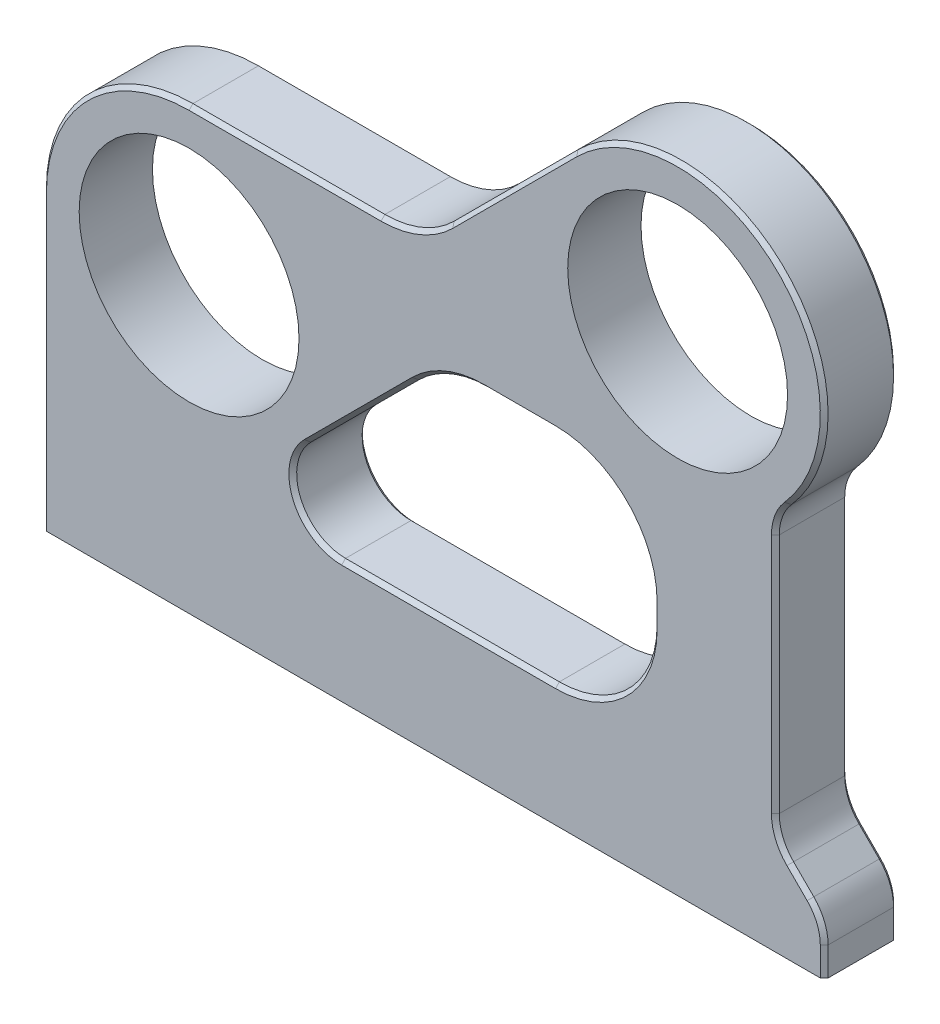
ISO-10303-21;
HEADER;
FILE_DESCRIPTION(('STEP AP214'),'2;1');
FILE_NAME('part.step','',(''),(''),'','','');
FILE_SCHEMA(('AUTOMOTIVE_DESIGN { 1 0 10303 214 1 1 1 1 }'));
ENDSEC;
DATA;
#1=APPLICATION_CONTEXT('core data for automotive mechanical design processes');
#2=APPLICATION_PROTOCOL_DEFINITION('international standard','automotive_design',2000,#1);
#3=PRODUCT_CONTEXT('',#1,'mechanical');
#4=PRODUCT('Part','Part','',(#3));
#5=PRODUCT_RELATED_PRODUCT_CATEGORY('part','',(#4));
#6=PRODUCT_DEFINITION_FORMATION('','',#4);
#7=PRODUCT_DEFINITION_CONTEXT('part definition',#1,'design');
#8=PRODUCT_DEFINITION('design','',#6,#7);
#9=PRODUCT_DEFINITION_SHAPE('','',#8);
#10=(LENGTH_UNIT() NAMED_UNIT(*) SI_UNIT(.MILLI.,.METRE.));
#11=(NAMED_UNIT(*) PLANE_ANGLE_UNIT() SI_UNIT($,.RADIAN.));
#12=(NAMED_UNIT(*) SI_UNIT($,.STERADIAN.) SOLID_ANGLE_UNIT());
#13=UNCERTAINTY_MEASURE_WITH_UNIT(LENGTH_MEASURE(1.E-05),#10,'distance_accuracy_value','');
#14=(GEOMETRIC_REPRESENTATION_CONTEXT(3) GLOBAL_UNCERTAINTY_ASSIGNED_CONTEXT((#13)) GLOBAL_UNIT_ASSIGNED_CONTEXT((#10,
#11,#12)) REPRESENTATION_CONTEXT('',''));
#15=CARTESIAN_POINT('',(0.,0.,0.));
#16=DIRECTION('',(0.,0.,1.));
#17=DIRECTION('',(1.,0.,0.));
#18=AXIS2_PLACEMENT_3D('',#15,#16,#17);
#19=CARTESIAN_POINT('',(82.55,8.59947917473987,4.7625));
#20=DIRECTION('',(0.,0.,-1.));
#21=DIRECTION('',(-1.,0.,0.));
#22=AXIS2_PLACEMENT_3D('',#19,#20,#21);
#23=PLANE('',#22);
#24=CARTESIAN_POINT('',(47.625,-9.525,4.7625));
#25=DIRECTION('',(0.,0.,-1.));
#26=DIRECTION('',(-1.,0.,0.));
#27=AXIS2_PLACEMENT_3D('',#24,#25,#26);
#28=CIRCLE('',#27,13.2080000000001);
#29=CARTESIAN_POINT('',(60.8330000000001,-9.525,4.7625));
#30=VERTEX_POINT('',#29);
#31=CARTESIAN_POINT('',(47.625,-22.7330000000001,4.7625));
#32=VERTEX_POINT('',#31);
#33=EDGE_CURVE('E619',#30,#32,#28,.T.);
#34=ORIENTED_EDGE('',*,*,#33,.T.);
#35=DIRECTION('',(-1.,0.,0.));
#36=VECTOR('',#35,1.);
#37=CARTESIAN_POINT('',(19.8278686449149,-22.7330000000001,4.7625));
#38=LINE('',#37,#36);
#39=CARTESIAN_POINT('',(19.8278686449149,-22.7330000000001,4.7625));
#40=VERTEX_POINT('',#39);
#41=EDGE_CURVE('E621',#32,#40,#38,.T.);
#42=ORIENTED_EDGE('',*,*,#41,.T.);
#43=CARTESIAN_POINT('',(19.8278686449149,-15.875,4.7625));
#44=DIRECTION('',(0.,0.,-1.));
#45=DIRECTION('',(-1.,0.,0.));
#46=AXIS2_PLACEMENT_3D('',#43,#44,#45);
#47=CIRCLE('',#46,6.85800000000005);
#48=CARTESIAN_POINT('',(14.9785303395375,-11.0256616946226,4.7625));
#49=VERTEX_POINT('',#48);
#50=EDGE_CURVE('E607',#40,#49,#47,.T.);
#51=ORIENTED_EDGE('',*,*,#50,.T.);
#52=DIRECTION('',(0.707106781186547,0.707106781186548,0.));
#53=VECTOR('',#52,1.);
#54=CARTESIAN_POINT('',(28.9936584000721,2.98946636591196,4.7625));
#55=LINE('',#54,#53);
#56=CARTESIAN_POINT('',(28.9936584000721,2.98946636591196,4.7625));
#57=VERTEX_POINT('',#56);
#58=EDGE_CURVE('E609',#49,#57,#55,.T.);
#59=ORIENTED_EDGE('',*,*,#58,.T.);
#60=CARTESIAN_POINT('',(38.3331247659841,-6.34999999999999,4.7625));
#61=DIRECTION('',(0.,0.,-1.));
#62=DIRECTION('',(-1.,0.,0.));
#63=AXIS2_PLACEMENT_3D('',#60,#61,#62);
#64=CIRCLE('',#63,13.2080000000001);
#65=CARTESIAN_POINT('',(38.3331247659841,6.85800000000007,4.7625));
#66=VERTEX_POINT('',#65);
#67=EDGE_CURVE('E611',#57,#66,#64,.T.);
#68=ORIENTED_EDGE('',*,*,#67,.T.);
#69=DIRECTION('',(1.,0.,0.));
#70=VECTOR('',#69,1.);
#71=CARTESIAN_POINT('',(47.625,6.85800000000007,4.7625));
#72=LINE('',#71,#70);
#73=CARTESIAN_POINT('',(47.625,6.85800000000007,4.7625));
#74=VERTEX_POINT('',#73);
#75=EDGE_CURVE('E613',#66,#74,#72,.T.);
#76=ORIENTED_EDGE('',*,*,#75,.T.);
#77=CARTESIAN_POINT('',(47.625,-6.34999999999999,4.7625));
#78=DIRECTION('',(0.,0.,-1.));
#79=DIRECTION('',(-1.,0.,0.));
#80=AXIS2_PLACEMENT_3D('',#77,#78,#79);
#81=CIRCLE('',#80,13.2080000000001);
#82=CARTESIAN_POINT('',(60.8330000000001,-6.34999999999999,4.7625));
#83=VERTEX_POINT('',#82);
#84=EDGE_CURVE('E615',#74,#83,#81,.T.);
#85=ORIENTED_EDGE('',*,*,#84,.T.);
#86=DIRECTION('',(0.,-1.,0.));
#87=VECTOR('',#86,1.);
#88=CARTESIAN_POINT('',(60.8330000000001,-9.525,4.7625));
#89=LINE('',#88,#87);
#90=EDGE_CURVE('E617',#83,#30,#89,.T.);
#91=ORIENTED_EDGE('',*,*,#90,.T.);
#92=EDGE_LOOP('',(#34,#42,#51,#59,#68,#76,#85,#91));
#93=FACE_BOUND('',#92,.T.);
#94=DIRECTION('',(1.,0.,0.));
#95=VECTOR('',#94,1.);
#96=CARTESIAN_POINT('',(-19.05,-38.1,4.7625));
#97=LINE('',#96,#95);
#98=CARTESIAN_POINT('',(-18.542,-38.1,4.7625));
#99=VERTEX_POINT('',#98);
#100=CARTESIAN_POINT('',(82.042,-38.1,4.76249999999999));
#101=VERTEX_POINT('',#100);
#102=EDGE_CURVE('E388',#99,#101,#97,.T.);
#103=ORIENTED_EDGE('',*,*,#102,.T.);
#104=DIRECTION('',(0.,1.,0.));
#105=VECTOR('',#104,1.);
#106=CARTESIAN_POINT('',(82.042,8.59947917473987,4.7625));
#107=LINE('',#106,#105);
#108=CARTESIAN_POINT('',(82.042,-34.3802561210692,4.7625));
#109=VERTEX_POINT('',#108);
#110=EDGE_CURVE('E533',#101,#109,#107,.T.);
#111=ORIENTED_EDGE('',*,*,#110,.T.);
#112=CARTESIAN_POINT('',(76.2,-34.3802561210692,4.7625));
#113=DIRECTION('',(0.,0.,-1.));
#114=DIRECTION('',(-1.,0.,0.));
#115=AXIS2_PLACEMENT_3D('',#112,#113,#114);
#116=CIRCLE('',#115,5.84199999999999);
#117=CARTESIAN_POINT('',(80.3309178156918,-30.2493383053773,4.7625));
#118=VERTEX_POINT('',#117);
#119=EDGE_CURVE('E531',#109,#118,#116,.F.);
#120=ORIENTED_EDGE('',*,*,#119,.T.);
#121=DIRECTION('',(-0.707106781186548,0.707106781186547,0.));
#122=VECTOR('',#121,1.);
#123=CARTESIAN_POINT('',(62.0160501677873,-11.9344706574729,4.7625));
#124=LINE('',#123,#122);
#125=CARTESIAN_POINT('',(77.7006616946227,-27.6190821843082,4.7625));
#126=VERTEX_POINT('',#125);
#127=EDGE_CURVE('E529',#118,#126,#124,.T.);
#128=ORIENTED_EDGE('',*,*,#127,.T.);
#129=CARTESIAN_POINT('',(82.55,-22.7697438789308,4.7625));
#130=DIRECTION('',(0.,0.,-1.));
#131=DIRECTION('',(-1.,0.,0.));
#132=AXIS2_PLACEMENT_3D('',#129,#130,#131);
#133=CIRCLE('',#132,6.858);
#134=CARTESIAN_POINT('',(75.692,-22.7697438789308,4.7625));
#135=VERTEX_POINT('',#134);
#136=EDGE_CURVE('E527',#126,#135,#133,.T.);
#137=ORIENTED_EDGE('',*,*,#136,.T.);
#138=DIRECTION('',(0.,1.,0.));
#139=VECTOR('',#138,1.);
#140=CARTESIAN_POINT('',(75.692,8.59947917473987,4.7625));
#141=LINE('',#140,#139);
#142=CARTESIAN_POINT('',(75.692,8.59947917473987,4.7625));
#143=VERTEX_POINT('',#142);
#144=EDGE_CURVE('E525',#135,#143,#141,.T.);
#145=ORIENTED_EDGE('',*,*,#144,.T.);
#146=CARTESIAN_POINT('',(82.55,8.59947917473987,4.7625));
#147=DIRECTION('',(0.,0.,-1.));
#148=DIRECTION('',(-1.,0.,0.));
#149=AXIS2_PLACEMENT_3D('',#146,#147,#148);
#150=CIRCLE('',#149,6.858);
#151=CARTESIAN_POINT('',(77.4065,13.1356197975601,4.7625));
#152=VERTEX_POINT('',#151);
#153=EDGE_CURVE('E523',#143,#152,#150,.T.);
#154=ORIENTED_EDGE('',*,*,#153,.T.);
#155=CARTESIAN_POINT('',(63.5,25.4,4.7625));
#156=DIRECTION('',(0.,0.,-1.));
#157=DIRECTION('',(-1.,0.,0.));
#158=AXIS2_PLACEMENT_3D('',#155,#156,#157);
#159=CIRCLE('',#158,18.542);
#160=CARTESIAN_POINT('',(50.388826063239,38.5111739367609,4.7625));
#161=VERTEX_POINT('',#160);
#162=EDGE_CURVE('E521',#152,#161,#159,.F.);
#163=ORIENTED_EDGE('',*,*,#162,.T.);
#164=DIRECTION('',(-0.707106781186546,-0.707106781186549,0.));
#165=VECTOR('',#164,1.);
#166=CARTESIAN_POINT('',(51.5135656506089,39.6359135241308,4.7625));
#167=LINE('',#166,#165);
#168=CARTESIAN_POINT('',(34.2881857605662,22.4105336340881,4.7625));
#169=VERTEX_POINT('',#168);
#170=EDGE_CURVE('E519',#161,#169,#167,.T.);
#171=ORIENTED_EDGE('',*,*,#170,.T.);
#172=CARTESIAN_POINT('',(24.9487193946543,31.75,4.7625));
#173=DIRECTION('',(0.,0.,-1.));
#174=DIRECTION('',(-1.,0.,0.));
#175=AXIS2_PLACEMENT_3D('',#172,#173,#174);
#176=CIRCLE('',#175,13.208);
#177=CARTESIAN_POINT('',(24.9487193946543,18.542,4.7625));
#178=VERTEX_POINT('',#177);
#179=EDGE_CURVE('E517',#169,#178,#176,.T.);
#180=ORIENTED_EDGE('',*,*,#179,.T.);
#181=DIRECTION('',(-1.,0.,0.));
#182=VECTOR('',#181,1.);
#183=CARTESIAN_POINT('',(82.55,18.542,4.7625));
#184=LINE('',#183,#182);
#185=CARTESIAN_POINT('',(0.,18.542,4.7625));
#186=VERTEX_POINT('',#185);
#187=EDGE_CURVE('E515',#178,#186,#184,.T.);
#188=ORIENTED_EDGE('',*,*,#187,.T.);
#189=CARTESIAN_POINT('',(0.,0.,4.7625));
#190=DIRECTION('',(0.,0.,-1.));
#191=DIRECTION('',(-1.,0.,0.));
#192=AXIS2_PLACEMENT_3D('',#189,#190,#191);
#193=CIRCLE('',#192,18.542);
#194=CARTESIAN_POINT('',(-18.542,0.,4.7625));
#195=VERTEX_POINT('',#194);
#196=EDGE_CURVE('E513',#186,#195,#193,.F.);
#197=ORIENTED_EDGE('',*,*,#196,.T.);
#198=DIRECTION('',(0.,-1.,0.));
#199=VECTOR('',#198,1.);
#200=CARTESIAN_POINT('',(-18.542,8.59947917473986,4.7625));
#201=LINE('',#200,#199);
#202=EDGE_CURVE('E511',#195,#99,#201,.T.);
#203=ORIENTED_EDGE('',*,*,#202,.T.);
#204=EDGE_LOOP('',(#103,#111,#120,#128,#137,#145,#154,#163,#171,#180,#188,#197,#203));
#205=FACE_BOUND('',#204,.T.);
#206=CARTESIAN_POINT('',(0.,0.,4.7625));
#207=DIRECTION('',(0.,0.,1.));
#208=DIRECTION('',(1.,0.,0.));
#209=AXIS2_PLACEMENT_3D('',#206,#207,#208);
#210=CIRCLE('',#209,14.2875);
#211=CARTESIAN_POINT('',(-14.2875,0.,4.7625));
#212=VERTEX_POINT('',#211);
#213=EDGE_CURVE('E382',#212,#212,#210,.T.);
#214=ORIENTED_EDGE('',*,*,#213,.F.);
#215=EDGE_LOOP('',(#214));
#216=FACE_BOUND('',#215,.T.);
#217=CARTESIAN_POINT('',(63.5,25.4,4.7625));
#218=DIRECTION('',(0.,0.,1.));
#219=DIRECTION('',(1.,0.,0.));
#220=AXIS2_PLACEMENT_3D('',#217,#218,#219);
#221=CIRCLE('',#220,14.2875);
#222=CARTESIAN_POINT('',(49.2125,25.4,4.7625));
#223=VERTEX_POINT('',#222);
#224=EDGE_CURVE('E352',#223,#223,#221,.T.);
#225=ORIENTED_EDGE('',*,*,#224,.F.);
#226=EDGE_LOOP('',(#225));
#227=FACE_BOUND('',#226,.T.);
#228=ADVANCED_FACE('F36',(#93,#205,#216,#227),#23,.F.);
#229=CARTESIAN_POINT('',(82.55,8.59947917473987,-4.7625));
#230=DIRECTION('',(0.,0.,-1.));
#231=DIRECTION('',(-1.,0.,0.));
#232=AXIS2_PLACEMENT_3D('',#229,#230,#231);
#233=PLANE('',#232);
#234=CARTESIAN_POINT('',(47.625,-9.525,-4.7625));
#235=DIRECTION('',(0.,0.,-1.));
#236=DIRECTION('',(-1.,0.,0.));
#237=AXIS2_PLACEMENT_3D('',#234,#235,#236);
#238=CIRCLE('',#237,13.208);
#239=CARTESIAN_POINT('',(47.625,-22.733,-4.7625));
#240=VERTEX_POINT('',#239);
#241=CARTESIAN_POINT('',(60.833,-9.525,-4.7625));
#242=VERTEX_POINT('',#241);
#243=EDGE_CURVE('E655',#240,#242,#238,.F.);
#244=ORIENTED_EDGE('',*,*,#243,.T.);
#245=DIRECTION('',(0.,1.,0.));
#246=VECTOR('',#245,1.);
#247=CARTESIAN_POINT('',(60.833,8.59947917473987,-4.7625));
#248=LINE('',#247,#246);
#249=CARTESIAN_POINT('',(60.833,-6.34999999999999,-4.7625));
#250=VERTEX_POINT('',#249);
#251=EDGE_CURVE('E11',#242,#250,#248,.T.);
#252=ORIENTED_EDGE('',*,*,#251,.T.);
#253=CARTESIAN_POINT('',(47.625,-6.34999999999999,-4.7625));
#254=DIRECTION('',(0.,0.,-1.));
#255=DIRECTION('',(-1.,0.,0.));
#256=AXIS2_PLACEMENT_3D('',#253,#254,#255);
#257=CIRCLE('',#256,13.208);
#258=CARTESIAN_POINT('',(47.625,6.85800000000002,-4.7625));
#259=VERTEX_POINT('',#258);
#260=EDGE_CURVE('E45',#250,#259,#257,.F.);
#261=ORIENTED_EDGE('',*,*,#260,.T.);
#262=DIRECTION('',(-1.,0.,0.));
#263=VECTOR('',#262,1.);
#264=CARTESIAN_POINT('',(82.55,6.85800000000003,-4.7625));
#265=LINE('',#264,#263);
#266=CARTESIAN_POINT('',(38.3331247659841,6.85800000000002,-4.7625));
#267=VERTEX_POINT('',#266);
#268=EDGE_CURVE('E663',#259,#267,#265,.T.);
#269=ORIENTED_EDGE('',*,*,#268,.T.);
#270=CARTESIAN_POINT('',(38.3331247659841,-6.34999999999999,-4.7625));
#271=DIRECTION('',(0.,0.,-1.));
#272=DIRECTION('',(-1.,0.,0.));
#273=AXIS2_PLACEMENT_3D('',#270,#271,#272);
#274=CIRCLE('',#273,13.208);
#275=CARTESIAN_POINT('',(28.9936584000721,2.98946636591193,-4.7625));
#276=VERTEX_POINT('',#275);
#277=EDGE_CURVE('E661',#267,#276,#274,.F.);
#278=ORIENTED_EDGE('',*,*,#277,.T.);
#279=DIRECTION('',(-0.707106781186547,-0.707106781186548,0.));
#280=VECTOR('',#279,1.);
#281=CARTESIAN_POINT('',(58.57683560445,32.5726435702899,-4.7625));
#282=LINE('',#281,#280);
#283=CARTESIAN_POINT('',(14.9785303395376,-11.0256616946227,-4.7625));
#284=VERTEX_POINT('',#283);
#285=EDGE_CURVE('E659',#276,#284,#282,.T.);
#286=ORIENTED_EDGE('',*,*,#285,.T.);
#287=CARTESIAN_POINT('',(19.8278686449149,-15.875,-4.7625));
#288=DIRECTION('',(0.,0.,-1.));
#289=DIRECTION('',(-1.,0.,0.));
#290=AXIS2_PLACEMENT_3D('',#287,#288,#289);
#291=CIRCLE('',#290,6.85800000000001);
#292=CARTESIAN_POINT('',(19.8278686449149,-22.733,-4.7625));
#293=VERTEX_POINT('',#292);
#294=EDGE_CURVE('E657',#284,#293,#291,.F.);
#295=ORIENTED_EDGE('',*,*,#294,.T.);
#296=DIRECTION('',(1.,0.,0.));
#297=VECTOR('',#296,1.);
#298=CARTESIAN_POINT('',(82.55,-22.733,-4.7625));
#299=LINE('',#298,#297);
#300=EDGE_CURVE('E653',#293,#240,#299,.T.);
#301=ORIENTED_EDGE('',*,*,#300,.T.);
#302=EDGE_LOOP('',(#244,#252,#261,#269,#278,#286,#295,#301));
#303=FACE_BOUND('',#302,.T.);
#304=CARTESIAN_POINT('',(76.2,-34.3802561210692,-4.7625));
#305=DIRECTION('',(0.,0.,-1.));
#306=DIRECTION('',(-1.,0.,0.));
#307=AXIS2_PLACEMENT_3D('',#304,#305,#306);
#308=CIRCLE('',#307,5.84200000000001);
#309=CARTESIAN_POINT('',(80.3309178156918,-30.2493383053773,-4.7625));
#310=VERTEX_POINT('',#309);
#311=CARTESIAN_POINT('',(82.042,-34.3802561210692,-4.7625));
#312=VERTEX_POINT('',#311);
#313=EDGE_CURVE('E455',#310,#312,#308,.T.);
#314=ORIENTED_EDGE('',*,*,#313,.T.);
#315=DIRECTION('',(0.,-1.,0.));
#316=VECTOR('',#315,1.);
#317=CARTESIAN_POINT('',(82.042,-38.1,-4.7625));
#318=LINE('',#317,#316);
#319=CARTESIAN_POINT('',(82.042,-38.1,-4.76250000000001));
#320=VERTEX_POINT('',#319);
#321=EDGE_CURVE('E457',#312,#320,#318,.T.);
#322=ORIENTED_EDGE('',*,*,#321,.T.);
#323=DIRECTION('',(1.,0.,0.));
#324=VECTOR('',#323,1.);
#325=CARTESIAN_POINT('',(-19.05,-38.1,-4.7625));
#326=LINE('',#325,#324);
#327=CARTESIAN_POINT('',(-18.542,-38.1,-4.7625));
#328=VERTEX_POINT('',#327);
#329=EDGE_CURVE('E385',#328,#320,#326,.T.);
#330=ORIENTED_EDGE('',*,*,#329,.F.);
#331=DIRECTION('',(0.,1.,0.));
#332=VECTOR('',#331,1.);
#333=CARTESIAN_POINT('',(-18.542,0.,-4.7625));
#334=LINE('',#333,#332);
#335=CARTESIAN_POINT('',(-18.542,0.,-4.7625));
#336=VERTEX_POINT('',#335);
#337=EDGE_CURVE('E435',#328,#336,#334,.T.);
#338=ORIENTED_EDGE('',*,*,#337,.T.);
#339=CARTESIAN_POINT('',(0.,0.,-4.7625));
#340=DIRECTION('',(0.,0.,-1.));
#341=DIRECTION('',(-1.,0.,0.));
#342=AXIS2_PLACEMENT_3D('',#339,#340,#341);
#343=CIRCLE('',#342,18.542);
#344=CARTESIAN_POINT('',(0.,18.542,-4.7625));
#345=VERTEX_POINT('',#344);
#346=EDGE_CURVE('E437',#336,#345,#343,.T.);
#347=ORIENTED_EDGE('',*,*,#346,.T.);
#348=DIRECTION('',(1.,0.,0.));
#349=VECTOR('',#348,1.);
#350=CARTESIAN_POINT('',(24.9487193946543,18.542,-4.7625));
#351=LINE('',#350,#349);
#352=CARTESIAN_POINT('',(24.9487193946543,18.542,-4.7625));
#353=VERTEX_POINT('',#352);
#354=EDGE_CURVE('E439',#345,#353,#351,.T.);
#355=ORIENTED_EDGE('',*,*,#354,.T.);
#356=CARTESIAN_POINT('',(24.9487193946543,31.75,-4.7625));
#357=DIRECTION('',(0.,0.,-1.));
#358=DIRECTION('',(-1.,0.,0.));
#359=AXIS2_PLACEMENT_3D('',#356,#357,#358);
#360=CIRCLE('',#359,13.208);
#361=CARTESIAN_POINT('',(34.2881857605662,22.4105336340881,-4.7625));
#362=VERTEX_POINT('',#361);
#363=EDGE_CURVE('E441',#353,#362,#360,.F.);
#364=ORIENTED_EDGE('',*,*,#363,.T.);
#365=DIRECTION('',(0.707106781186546,0.707106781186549,0.));
#366=VECTOR('',#365,1.);
#367=CARTESIAN_POINT('',(50.388826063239,38.5111739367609,-4.7625));
#368=LINE('',#367,#366);
#369=CARTESIAN_POINT('',(50.388826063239,38.5111739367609,-4.7625));
#370=VERTEX_POINT('',#369);
#371=EDGE_CURVE('E443',#362,#370,#368,.T.);
#372=ORIENTED_EDGE('',*,*,#371,.T.);
#373=CARTESIAN_POINT('',(63.5,25.4,-4.7625));
#374=DIRECTION('',(0.,0.,-1.));
#375=DIRECTION('',(-1.,0.,0.));
#376=AXIS2_PLACEMENT_3D('',#373,#374,#375);
#377=CIRCLE('',#376,18.542);
#378=CARTESIAN_POINT('',(77.4065,13.1356197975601,-4.7625));
#379=VERTEX_POINT('',#378);
#380=EDGE_CURVE('E445',#370,#379,#377,.T.);
#381=ORIENTED_EDGE('',*,*,#380,.T.);
#382=CARTESIAN_POINT('',(82.55,8.59947917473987,-4.7625));
#383=DIRECTION('',(0.,0.,-1.));
#384=DIRECTION('',(-1.,0.,0.));
#385=AXIS2_PLACEMENT_3D('',#382,#383,#384);
#386=CIRCLE('',#385,6.85799999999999);
#387=CARTESIAN_POINT('',(75.692,8.59947917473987,-4.7625));
#388=VERTEX_POINT('',#387);
#389=EDGE_CURVE('E447',#379,#388,#386,.F.);
#390=ORIENTED_EDGE('',*,*,#389,.T.);
#391=DIRECTION('',(0.,-1.,0.));
#392=VECTOR('',#391,1.);
#393=CARTESIAN_POINT('',(75.692,-22.7697438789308,-4.7625));
#394=LINE('',#393,#392);
#395=CARTESIAN_POINT('',(75.692,-22.7697438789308,-4.7625));
#396=VERTEX_POINT('',#395);
#397=EDGE_CURVE('E449',#388,#396,#394,.T.);
#398=ORIENTED_EDGE('',*,*,#397,.T.);
#399=CARTESIAN_POINT('',(82.55,-22.7697438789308,-4.7625));
#400=DIRECTION('',(0.,0.,-1.));
#401=DIRECTION('',(-1.,0.,0.));
#402=AXIS2_PLACEMENT_3D('',#399,#400,#401);
#403=CIRCLE('',#402,6.85799999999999);
#404=CARTESIAN_POINT('',(77.7006616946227,-27.6190821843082,-4.7625));
#405=VERTEX_POINT('',#404);
#406=EDGE_CURVE('E451',#396,#405,#403,.F.);
#407=ORIENTED_EDGE('',*,*,#406,.T.);
#408=DIRECTION('',(0.707106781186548,-0.707106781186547,0.));
#409=VECTOR('',#408,1.);
#410=CARTESIAN_POINT('',(80.3309178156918,-30.2493383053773,-4.7625));
#411=LINE('',#410,#409);
#412=EDGE_CURVE('E453',#405,#310,#411,.T.);
#413=ORIENTED_EDGE('',*,*,#412,.T.);
#414=EDGE_LOOP('',(#314,#322,#330,#338,#347,#355,#364,#372,#381,#390,#398,#407,#413));
#415=FACE_BOUND('',#414,.T.);
#416=CARTESIAN_POINT('',(0.,0.,-4.7625));
#417=DIRECTION('',(0.,0.,1.));
#418=DIRECTION('',(1.,0.,0.));
#419=AXIS2_PLACEMENT_3D('',#416,#417,#418);
#420=CIRCLE('',#419,14.2875);
#421=CARTESIAN_POINT('',(-14.2875,0.,-4.7625));
#422=VERTEX_POINT('',#421);
#423=EDGE_CURVE('E379',#422,#422,#420,.T.);
#424=ORIENTED_EDGE('',*,*,#423,.T.);
#425=EDGE_LOOP('',(#424));
#426=FACE_BOUND('',#425,.T.);
#427=CARTESIAN_POINT('',(63.5,25.4,-4.7625));
#428=DIRECTION('',(0.,0.,1.));
#429=DIRECTION('',(1.,0.,0.));
#430=AXIS2_PLACEMENT_3D('',#427,#428,#429);
#431=CIRCLE('',#430,14.2875);
#432=CARTESIAN_POINT('',(49.2125,25.4,-4.7625));
#433=VERTEX_POINT('',#432);
#434=EDGE_CURVE('E349',#433,#433,#431,.T.);
#435=ORIENTED_EDGE('',*,*,#434,.T.);
#436=EDGE_LOOP('',(#435));
#437=FACE_BOUND('',#436,.T.);
#438=ADVANCED_FACE('F787',(#303,#415,#426,#437),#233,.T.);
#439=CARTESIAN_POINT('',(82.55,8.59947917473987,4.7625));
#440=DIRECTION('',(0.,0.,-1.));
#441=DIRECTION('',(-1.,0.,0.));
#442=AXIS2_PLACEMENT_3D('',#439,#440,#441);
#443=CYLINDRICAL_SURFACE('',#442,6.35);
#444=DIRECTION('',(0.,0.,-1.));
#445=VECTOR('',#444,1.);
#446=CARTESIAN_POINT('',(76.2,8.59947917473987,4.7625));
#447=LINE('',#446,#445);
#448=CARTESIAN_POINT('',(76.2,8.59947917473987,4.25449999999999));
#449=VERTEX_POINT('',#448);
#450=CARTESIAN_POINT('',(76.2,8.59947917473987,-4.2545));
#451=VERTEX_POINT('',#450);
#452=EDGE_CURVE('E391',#449,#451,#447,.T.);
#453=ORIENTED_EDGE('',*,*,#452,.T.);
#454=CARTESIAN_POINT('',(82.55,8.59947917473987,-4.25450000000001));
#455=DIRECTION('',(0.,0.,-1.));
#456=DIRECTION('',(-1.,0.,0.));
#457=AXIS2_PLACEMENT_3D('',#454,#455,#456);
#458=CIRCLE('',#457,6.35);
#459=CARTESIAN_POINT('',(77.7875,12.7996093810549,-4.2545));
#460=VERTEX_POINT('',#459);
#461=EDGE_CURVE('E485',#451,#460,#458,.T.);
#462=ORIENTED_EDGE('',*,*,#461,.T.);
#463=DIRECTION('',(0.,0.,-1.));
#464=VECTOR('',#463,1.);
#465=CARTESIAN_POINT('',(77.7875,12.7996093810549,4.7625));
#466=LINE('',#465,#464);
#467=CARTESIAN_POINT('',(77.7875,12.7996093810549,4.25449999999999));
#468=VERTEX_POINT('',#467);
#469=EDGE_CURVE('E427',#468,#460,#466,.T.);
#470=ORIENTED_EDGE('',*,*,#469,.F.);
#471=CARTESIAN_POINT('',(82.55,8.59947917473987,4.25449999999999));
#472=DIRECTION('',(0.,0.,-1.));
#473=DIRECTION('',(-1.,0.,0.));
#474=AXIS2_PLACEMENT_3D('',#471,#472,#473);
#475=CIRCLE('',#474,6.35);
#476=EDGE_CURVE('E483',#468,#449,#475,.F.);
#477=ORIENTED_EDGE('',*,*,#476,.T.);
#478=EDGE_LOOP('',(#453,#462,#470,#477));
#479=FACE_BOUND('',#478,.T.);
#480=ADVANCED_FACE('F804',(#479),#443,.F.);
#481=CARTESIAN_POINT('',(63.5,25.4,4.7625));
#482=DIRECTION('',(0.,0.,-1.));
#483=DIRECTION('',(-1.,0.,0.));
#484=AXIS2_PLACEMENT_3D('',#481,#482,#483);
#485=CYLINDRICAL_SURFACE('',#484,19.05);
#486=ORIENTED_EDGE('',*,*,#469,.T.);
#487=CARTESIAN_POINT('',(63.5,25.4,-4.25450000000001));
#488=DIRECTION('',(0.,0.,-1.));
#489=DIRECTION('',(-1.,0.,0.));
#490=AXIS2_PLACEMENT_3D('',#487,#488,#489);
#491=CIRCLE('',#490,19.05);
#492=CARTESIAN_POINT('',(50.0296158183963,38.8703841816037,-4.2545));
#493=VERTEX_POINT('',#492);
#494=EDGE_CURVE('E489',#460,#493,#491,.F.);
#495=ORIENTED_EDGE('',*,*,#494,.T.);
#496=DIRECTION('',(0.,0.,-1.));
#497=VECTOR('',#496,1.);
#498=CARTESIAN_POINT('',(50.0296158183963,38.8703841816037,4.7625));
#499=LINE('',#498,#497);
#500=CARTESIAN_POINT('',(50.0296158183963,38.8703841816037,4.25449999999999));
#501=VERTEX_POINT('',#500);
#502=EDGE_CURVE('E424',#501,#493,#499,.T.);
#503=ORIENTED_EDGE('',*,*,#502,.F.);
#504=CARTESIAN_POINT('',(63.5,25.4,4.25449999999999));
#505=DIRECTION('',(0.,0.,-1.));
#506=DIRECTION('',(-1.,0.,0.));
#507=AXIS2_PLACEMENT_3D('',#504,#505,#506);
#508=CIRCLE('',#507,19.05);
#509=EDGE_CURVE('E487',#501,#468,#508,.T.);
#510=ORIENTED_EDGE('',*,*,#509,.T.);
#511=EDGE_LOOP('',(#486,#495,#503,#510));
#512=FACE_BOUND('',#511,.T.);
#513=ADVANCED_FACE('F809',(#512),#485,.T.);
#514=CARTESIAN_POINT('',(50.0296158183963,38.8703841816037,4.7625));
#515=DIRECTION('',(0.707106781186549,-0.707106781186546,0.));
#516=DIRECTION('',(0.707106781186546,0.707106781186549,0.));
#517=AXIS2_PLACEMENT_3D('',#514,#515,#516);
#518=PLANE('',#517);
#519=ORIENTED_EDGE('',*,*,#502,.T.);
#520=DIRECTION('',(-0.707106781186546,-0.707106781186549,0.));
#521=VECTOR('',#520,1.);
#522=CARTESIAN_POINT('',(33.9289755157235,22.7697438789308,-4.25450000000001));
#523=LINE('',#522,#521);
#524=CARTESIAN_POINT('',(33.9289755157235,22.7697438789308,-4.2545));
#525=VERTEX_POINT('',#524);
#526=EDGE_CURVE('E493',#493,#525,#523,.T.);
#527=ORIENTED_EDGE('',*,*,#526,.T.);
#528=DIRECTION('',(0.,0.,-1.));
#529=VECTOR('',#528,1.);
#530=CARTESIAN_POINT('',(33.9289755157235,22.7697438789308,4.7625));
#531=LINE('',#530,#529);
#532=CARTESIAN_POINT('',(33.9289755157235,22.7697438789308,4.25449999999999));
#533=VERTEX_POINT('',#532);
#534=EDGE_CURVE('E421',#533,#525,#531,.T.);
#535=ORIENTED_EDGE('',*,*,#534,.F.);
#536=DIRECTION('',(0.707106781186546,0.707106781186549,0.));
#537=VECTOR('',#536,1.);
#538=CARTESIAN_POINT('',(50.0296158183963,38.8703841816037,4.25449999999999));
#539=LINE('',#538,#537);
#540=EDGE_CURVE('E491',#533,#501,#539,.T.);
#541=ORIENTED_EDGE('',*,*,#540,.T.);
#542=EDGE_LOOP('',(#519,#527,#535,#541));
#543=FACE_BOUND('',#542,.T.);
#544=ADVANCED_FACE('F856',(#543),#518,.F.);
#545=CARTESIAN_POINT('',(24.9487193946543,31.75,4.7625));
#546=DIRECTION('',(0.,0.,-1.));
#547=DIRECTION('',(-1.,0.,0.));
#548=AXIS2_PLACEMENT_3D('',#545,#546,#547);
#549=CYLINDRICAL_SURFACE('',#548,12.7);
#550=ORIENTED_EDGE('',*,*,#534,.T.);
#551=CARTESIAN_POINT('',(24.9487193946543,31.75,-4.25450000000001));
#552=DIRECTION('',(0.,0.,-1.));
#553=DIRECTION('',(-1.,0.,0.));
#554=AXIS2_PLACEMENT_3D('',#551,#552,#553);
#555=CIRCLE('',#554,12.7);
#556=CARTESIAN_POINT('',(24.9487193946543,19.05,-4.2545));
#557=VERTEX_POINT('',#556);
#558=EDGE_CURVE('E497',#525,#557,#555,.T.);
#559=ORIENTED_EDGE('',*,*,#558,.T.);
#560=DIRECTION('',(0.,0.,-1.));
#561=VECTOR('',#560,1.);
#562=CARTESIAN_POINT('',(24.9487193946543,19.05,4.7625));
#563=LINE('',#562,#561);
#564=CARTESIAN_POINT('',(24.9487193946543,19.05,4.25449999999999));
#565=VERTEX_POINT('',#564);
#566=EDGE_CURVE('E418',#565,#557,#563,.T.);
#567=ORIENTED_EDGE('',*,*,#566,.F.);
#568=CARTESIAN_POINT('',(24.9487193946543,31.75,4.25449999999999));
#569=DIRECTION('',(0.,0.,-1.));
#570=DIRECTION('',(-1.,0.,0.));
#571=AXIS2_PLACEMENT_3D('',#568,#569,#570);
#572=CIRCLE('',#571,12.7);
#573=EDGE_CURVE('E495',#565,#533,#572,.F.);
#574=ORIENTED_EDGE('',*,*,#573,.T.);
#575=EDGE_LOOP('',(#550,#559,#567,#574));
#576=FACE_BOUND('',#575,.T.);
#577=ADVANCED_FACE('F852',(#576),#549,.F.);
#578=CARTESIAN_POINT('',(0.,19.05,4.7625));
#579=DIRECTION('',(0.,-1.,0.));
#580=DIRECTION('',(0.,0.,-1.));
#581=AXIS2_PLACEMENT_3D('',#578,#579,#580);
#582=PLANE('',#581);
#583=ORIENTED_EDGE('',*,*,#566,.T.);
#584=DIRECTION('',(-1.,0.,0.));
#585=VECTOR('',#584,1.);
#586=CARTESIAN_POINT('',(0.,19.05,-4.25450000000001));
#587=LINE('',#586,#585);
#588=CARTESIAN_POINT('',(0.,19.05,-4.2545));
#589=VERTEX_POINT('',#588);
#590=EDGE_CURVE('E501',#557,#589,#587,.T.);
#591=ORIENTED_EDGE('',*,*,#590,.T.);
#592=DIRECTION('',(0.,0.,-1.));
#593=VECTOR('',#592,1.);
#594=CARTESIAN_POINT('',(0.,19.05,4.7625));
#595=LINE('',#594,#593);
#596=CARTESIAN_POINT('',(0.,19.05,4.25449999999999));
#597=VERTEX_POINT('',#596);
#598=EDGE_CURVE('E415',#597,#589,#595,.T.);
#599=ORIENTED_EDGE('',*,*,#598,.F.);
#600=DIRECTION('',(1.,0.,0.));
#601=VECTOR('',#600,1.);
#602=CARTESIAN_POINT('',(0.,19.05,4.25449999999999));
#603=LINE('',#602,#601);
#604=EDGE_CURVE('E499',#597,#565,#603,.T.);
#605=ORIENTED_EDGE('',*,*,#604,.T.);
#606=EDGE_LOOP('',(#583,#591,#599,#605));
#607=FACE_BOUND('',#606,.T.);
#608=ADVANCED_FACE('F848',(#607),#582,.F.);
#609=CARTESIAN_POINT('',(0.,0.,4.7625));
#610=DIRECTION('',(0.,0.,-1.));
#611=DIRECTION('',(-1.,0.,0.));
#612=AXIS2_PLACEMENT_3D('',#609,#610,#611);
#613=CYLINDRICAL_SURFACE('',#612,19.05);
#614=ORIENTED_EDGE('',*,*,#598,.T.);
#615=CARTESIAN_POINT('',(0.,0.,-4.25450000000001));
#616=DIRECTION('',(0.,0.,-1.));
#617=DIRECTION('',(-1.,0.,0.));
#618=AXIS2_PLACEMENT_3D('',#615,#616,#617);
#619=CIRCLE('',#618,19.05);
#620=CARTESIAN_POINT('',(-19.05,0.,-4.2545));
#621=VERTEX_POINT('',#620);
#622=EDGE_CURVE('E505',#589,#621,#619,.F.);
#623=ORIENTED_EDGE('',*,*,#622,.T.);
#624=DIRECTION('',(0.,0.,-1.));
#625=VECTOR('',#624,1.);
#626=CARTESIAN_POINT('',(-19.05,0.,4.7625));
#627=LINE('',#626,#625);
#628=CARTESIAN_POINT('',(-19.05,0.,4.25449999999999));
#629=VERTEX_POINT('',#628);
#630=EDGE_CURVE('E412',#629,#621,#627,.T.);
#631=ORIENTED_EDGE('',*,*,#630,.F.);
#632=CARTESIAN_POINT('',(0.,0.,4.25449999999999));
#633=DIRECTION('',(0.,0.,-1.));
#634=DIRECTION('',(-1.,0.,0.));
#635=AXIS2_PLACEMENT_3D('',#632,#633,#634);
#636=CIRCLE('',#635,19.05);
#637=EDGE_CURVE('E503',#629,#597,#636,.T.);
#638=ORIENTED_EDGE('',*,*,#637,.T.);
#639=EDGE_LOOP('',(#614,#623,#631,#638));
#640=FACE_BOUND('',#639,.T.);
#641=ADVANCED_FACE('F844',(#640),#613,.T.);
#642=CARTESIAN_POINT('',(-19.05,0.,4.7625));
#643=DIRECTION('',(1.,0.,0.));
#644=DIRECTION('',(0.,1.,0.));
#645=AXIS2_PLACEMENT_3D('',#642,#643,#644);
#646=PLANE('',#645);
#647=ORIENTED_EDGE('',*,*,#630,.T.);
#648=DIRECTION('',(0.,-1.,0.));
#649=VECTOR('',#648,1.);
#650=CARTESIAN_POINT('',(-19.05,-38.1,-4.25450000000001));
#651=LINE('',#650,#649);
#652=CARTESIAN_POINT('',(-19.05,-38.1,-4.2545));
#653=VERTEX_POINT('',#652);
#654=EDGE_CURVE('E509',#621,#653,#651,.T.);
#655=ORIENTED_EDGE('',*,*,#654,.T.);
#656=DIRECTION('',(0.,0.,-1.));
#657=VECTOR('',#656,1.);
#658=CARTESIAN_POINT('',(-19.05,-38.1,4.7625));
#659=LINE('',#658,#657);
#660=CARTESIAN_POINT('',(-19.05,-38.1,4.25449999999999));
#661=VERTEX_POINT('',#660);
#662=EDGE_CURVE('E409',#661,#653,#659,.T.);
#663=ORIENTED_EDGE('',*,*,#662,.F.);
#664=DIRECTION('',(0.,1.,0.));
#665=VECTOR('',#664,1.);
#666=CARTESIAN_POINT('',(-19.05,0.,4.25449999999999));
#667=LINE('',#666,#665);
#668=EDGE_CURVE('E507',#661,#629,#667,.T.);
#669=ORIENTED_EDGE('',*,*,#668,.T.);
#670=EDGE_LOOP('',(#647,#655,#663,#669));
#671=FACE_BOUND('',#670,.T.);
#672=ADVANCED_FACE('F840',(#671),#646,.F.);
#673=CARTESIAN_POINT('',(-19.05,-38.1,4.7625));
#674=DIRECTION('',(0.,1.,0.));
#675=DIRECTION('',(-1.,0.,0.));
#676=AXIS2_PLACEMENT_3D('',#673,#674,#675);
#677=PLANE('',#676);
#678=CARTESIAN_POINT('',(50.8,-38.1,0.));
#679=DIRECTION('',(0.,-1.,0.));
#680=DIRECTION('',(1.,0.,0.));
#681=AXIS2_PLACEMENT_3D('',#678,#679,#680);
#682=CIRCLE('',#681,2.38125);
#683=CARTESIAN_POINT('',(53.18125,-38.1,0.));
#684=VERTEX_POINT('',#683);
#685=EDGE_CURVE('E570',#684,#684,#682,.T.);
#686=ORIENTED_EDGE('',*,*,#685,.F.);
#687=EDGE_LOOP('',(#686));
#688=FACE_BOUND('',#687,.T.);
#689=CARTESIAN_POINT('',(0.,-38.1,0.));
#690=DIRECTION('',(0.,-1.,0.));
#691=DIRECTION('',(1.,0.,0.));
#692=AXIS2_PLACEMENT_3D('',#689,#690,#691);
#693=CIRCLE('',#692,2.38125);
#694=CARTESIAN_POINT('',(2.38124999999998,-38.1,0.));
#695=VERTEX_POINT('',#694);
#696=EDGE_CURVE('E328',#695,#695,#693,.T.);
#697=ORIENTED_EDGE('',*,*,#696,.F.);
#698=EDGE_LOOP('',(#697));
#699=FACE_BOUND('',#698,.T.);
#700=CARTESIAN_POINT('',(63.5,-38.1,0.));
#701=DIRECTION('',(0.,-1.,0.));
#702=DIRECTION('',(0.,0.,-1.));
#703=AXIS2_PLACEMENT_3D('',#700,#701,#702);
#704=CIRCLE('',#703,2.0828);
#705=CARTESIAN_POINT('',(63.5,-38.1,-2.0828));
#706=VERTEX_POINT('',#705);
#707=EDGE_CURVE('E334',#706,#706,#704,.T.);
#708=ORIENTED_EDGE('',*,*,#707,.F.);
#709=EDGE_LOOP('',(#708));
#710=FACE_BOUND('',#709,.T.);
#711=CARTESIAN_POINT('',(-12.7,-38.1,0.));
#712=DIRECTION('',(0.,-1.,0.));
#713=DIRECTION('',(0.,0.,-1.));
#714=AXIS2_PLACEMENT_3D('',#711,#712,#713);
#715=CIRCLE('',#714,2.0828);
#716=CARTESIAN_POINT('',(-12.7,-38.1,-2.0828));
#717=VERTEX_POINT('',#716);
#718=EDGE_CURVE('E346',#717,#717,#715,.T.);
#719=ORIENTED_EDGE('',*,*,#718,.F.);
#720=EDGE_LOOP('',(#719));
#721=FACE_BOUND('',#720,.T.);
#722=ORIENTED_EDGE('',*,*,#329,.T.);
#723=DIRECTION('',(0.707106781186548,0.,0.707106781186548));
#724=VECTOR('',#723,1.);
#725=CARTESIAN_POINT('',(82.55,-38.1,-4.25450000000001));
#726=LINE('',#725,#724);
#727=CARTESIAN_POINT('',(82.55,-38.1,-4.2545));
#728=VERTEX_POINT('',#727);
#729=EDGE_CURVE('E465',#320,#728,#726,.T.);
#730=ORIENTED_EDGE('',*,*,#729,.T.);
#731=DIRECTION('',(0.,0.,-1.));
#732=VECTOR('',#731,1.);
#733=CARTESIAN_POINT('',(82.55,-38.1,4.7625));
#734=LINE('',#733,#732);
#735=CARTESIAN_POINT('',(82.55,-38.1,4.25449999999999));
#736=VERTEX_POINT('',#735);
#737=EDGE_CURVE('E406',#736,#728,#734,.T.);
#738=ORIENTED_EDGE('',*,*,#737,.F.);
#739=DIRECTION('',(0.707106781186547,0.,-0.707106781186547));
#740=VECTOR('',#739,1.);
#741=CARTESIAN_POINT('',(82.042,-38.1,4.7625));
#742=LINE('',#741,#740);
#743=EDGE_CURVE('E461',#736,#101,#742,.F.);
#744=ORIENTED_EDGE('',*,*,#743,.T.);
#745=ORIENTED_EDGE('',*,*,#102,.F.);
#746=DIRECTION('',(0.707106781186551,0.,0.707106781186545));
#747=VECTOR('',#746,1.);
#748=CARTESIAN_POINT('',(-18.542,-38.1,4.7625));
#749=LINE('',#748,#747);
#750=EDGE_CURVE('E459',#99,#661,#749,.F.);
#751=ORIENTED_EDGE('',*,*,#750,.T.);
#752=ORIENTED_EDGE('',*,*,#662,.T.);
#753=DIRECTION('',(0.70710678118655,0.,-0.707106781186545));
#754=VECTOR('',#753,1.);
#755=CARTESIAN_POINT('',(-19.05,-38.1,-4.25450000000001));
#756=LINE('',#755,#754);
#757=EDGE_CURVE('E463',#653,#328,#756,.T.);
#758=ORIENTED_EDGE('',*,*,#757,.T.);
#759=EDGE_LOOP('',(#722,#730,#738,#744,#745,#751,#752,#758));
#760=FACE_BOUND('',#759,.T.);
#761=ADVANCED_FACE('F836',(#688,#699,#710,#721,#760),#677,.F.);
#762=CARTESIAN_POINT('',(82.55,-34.3802561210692,4.7625));
#763=DIRECTION('',(-1.,0.,0.));
#764=DIRECTION('',(0.,0.,1.));
#765=AXIS2_PLACEMENT_3D('',#762,#763,#764);
#766=PLANE('',#765);
#767=ORIENTED_EDGE('',*,*,#737,.T.);
#768=DIRECTION('',(0.,1.,0.));
#769=VECTOR('',#768,1.);
#770=CARTESIAN_POINT('',(82.55,-34.3802561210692,-4.25450000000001));
#771=LINE('',#770,#769);
#772=CARTESIAN_POINT('',(82.55,-34.3802561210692,-4.2545));
#773=VERTEX_POINT('',#772);
#774=EDGE_CURVE('E432',#728,#773,#771,.T.);
#775=ORIENTED_EDGE('',*,*,#774,.T.);
#776=DIRECTION('',(0.,0.,-1.));
#777=VECTOR('',#776,1.);
#778=CARTESIAN_POINT('',(82.55,-34.3802561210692,4.7625));
#779=LINE('',#778,#777);
#780=CARTESIAN_POINT('',(82.55,-34.3802561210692,4.25449999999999));
#781=VERTEX_POINT('',#780);
#782=EDGE_CURVE('E403',#781,#773,#779,.T.);
#783=ORIENTED_EDGE('',*,*,#782,.F.);
#784=DIRECTION('',(0.,-1.,0.));
#785=VECTOR('',#784,1.);
#786=CARTESIAN_POINT('',(82.55,-34.3802561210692,4.25449999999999));
#787=LINE('',#786,#785);
#788=EDGE_CURVE('E430',#781,#736,#787,.T.);
#789=ORIENTED_EDGE('',*,*,#788,.T.);
#790=EDGE_LOOP('',(#767,#775,#783,#789));
#791=FACE_BOUND('',#790,.T.);
#792=ADVANCED_FACE('F832',(#791),#766,.F.);
#793=CARTESIAN_POINT('',(76.2,-34.3802561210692,4.7625));
#794=DIRECTION('',(0.,0.,-1.));
#795=DIRECTION('',(-1.,0.,0.));
#796=AXIS2_PLACEMENT_3D('',#793,#794,#795);
#797=CYLINDRICAL_SURFACE('',#796,6.35);
#798=ORIENTED_EDGE('',*,*,#782,.T.);
#799=CARTESIAN_POINT('',(76.2,-34.3802561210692,-4.25450000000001));
#800=DIRECTION('',(0.,0.,-1.));
#801=DIRECTION('',(-1.,0.,0.));
#802=AXIS2_PLACEMENT_3D('',#799,#800,#801);
#803=CIRCLE('',#802,6.35);
#804=CARTESIAN_POINT('',(80.6901280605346,-29.8901280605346,-4.2545));
#805=VERTEX_POINT('',#804);
#806=EDGE_CURVE('E469',#773,#805,#803,.F.);
#807=ORIENTED_EDGE('',*,*,#806,.T.);
#808=DIRECTION('',(0.,0.,-1.));
#809=VECTOR('',#808,1.);
#810=CARTESIAN_POINT('',(80.6901280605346,-29.8901280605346,4.7625));
#811=LINE('',#810,#809);
#812=CARTESIAN_POINT('',(80.6901280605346,-29.8901280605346,4.25449999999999));
#813=VERTEX_POINT('',#812);
#814=EDGE_CURVE('E400',#813,#805,#811,.T.);
#815=ORIENTED_EDGE('',*,*,#814,.F.);
#816=CARTESIAN_POINT('',(76.2,-34.3802561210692,4.25449999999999));
#817=DIRECTION('',(0.,0.,-1.));
#818=DIRECTION('',(-1.,0.,0.));
#819=AXIS2_PLACEMENT_3D('',#816,#817,#818);
#820=CIRCLE('',#819,6.35);
#821=EDGE_CURVE('E467',#813,#781,#820,.T.);
#822=ORIENTED_EDGE('',*,*,#821,.T.);
#823=EDGE_LOOP('',(#798,#807,#815,#822));
#824=FACE_BOUND('',#823,.T.);
#825=ADVANCED_FACE('F828',(#824),#797,.T.);
#826=CARTESIAN_POINT('',(78.0598719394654,-27.2598719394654,4.7625));
#827=DIRECTION('',(-0.707106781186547,-0.707106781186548,0.));
#828=DIRECTION('',(0.707106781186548,-0.707106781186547,0.));
#829=AXIS2_PLACEMENT_3D('',#826,#827,#828);
#830=PLANE('',#829);
#831=ORIENTED_EDGE('',*,*,#814,.T.);
#832=DIRECTION('',(-0.707106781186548,0.707106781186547,0.));
#833=VECTOR('',#832,1.);
#834=CARTESIAN_POINT('',(78.0598719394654,-27.2598719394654,-4.25450000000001));
#835=LINE('',#834,#833);
#836=CARTESIAN_POINT('',(78.0598719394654,-27.2598719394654,-4.2545));
#837=VERTEX_POINT('',#836);
#838=EDGE_CURVE('E473',#805,#837,#835,.T.);
#839=ORIENTED_EDGE('',*,*,#838,.T.);
#840=DIRECTION('',(0.,0.,-1.));
#841=VECTOR('',#840,1.);
#842=CARTESIAN_POINT('',(78.0598719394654,-27.2598719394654,4.7625));
#843=LINE('',#842,#841);
#844=CARTESIAN_POINT('',(78.0598719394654,-27.2598719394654,4.25449999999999));
#845=VERTEX_POINT('',#844);
#846=EDGE_CURVE('E397',#845,#837,#843,.T.);
#847=ORIENTED_EDGE('',*,*,#846,.F.);
#848=DIRECTION('',(0.707106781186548,-0.707106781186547,0.));
#849=VECTOR('',#848,1.);
#850=CARTESIAN_POINT('',(78.0598719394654,-27.2598719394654,4.25449999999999));
#851=LINE('',#850,#849);
#852=EDGE_CURVE('E471',#845,#813,#851,.T.);
#853=ORIENTED_EDGE('',*,*,#852,.T.);
#854=EDGE_LOOP('',(#831,#839,#847,#853));
#855=FACE_BOUND('',#854,.T.);
#856=ADVANCED_FACE('F824',(#855),#830,.F.);
#857=CARTESIAN_POINT('',(82.55,-22.7697438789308,4.7625));
#858=DIRECTION('',(0.,0.,-1.));
#859=DIRECTION('',(-1.,0.,0.));
#860=AXIS2_PLACEMENT_3D('',#857,#858,#859);
#861=CYLINDRICAL_SURFACE('',#860,6.35);
#862=ORIENTED_EDGE('',*,*,#846,.T.);
#863=CARTESIAN_POINT('',(82.55,-22.7697438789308,-4.25450000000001));
#864=DIRECTION('',(0.,0.,-1.));
#865=DIRECTION('',(-1.,0.,0.));
#866=AXIS2_PLACEMENT_3D('',#863,#864,#865);
#867=CIRCLE('',#866,6.35);
#868=CARTESIAN_POINT('',(76.2,-22.7697438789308,-4.2545));
#869=VERTEX_POINT('',#868);
#870=EDGE_CURVE('E477',#837,#869,#867,.T.);
#871=ORIENTED_EDGE('',*,*,#870,.T.);
#872=DIRECTION('',(0.,0.,-1.));
#873=VECTOR('',#872,1.);
#874=CARTESIAN_POINT('',(76.2,-22.7697438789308,4.7625));
#875=LINE('',#874,#873);
#876=CARTESIAN_POINT('',(76.2,-22.7697438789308,4.25449999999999));
#877=VERTEX_POINT('',#876);
#878=EDGE_CURVE('E394',#877,#869,#875,.T.);
#879=ORIENTED_EDGE('',*,*,#878,.F.);
#880=CARTESIAN_POINT('',(82.55,-22.7697438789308,4.25449999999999));
#881=DIRECTION('',(0.,0.,-1.));
#882=DIRECTION('',(-1.,0.,0.));
#883=AXIS2_PLACEMENT_3D('',#880,#881,#882);
#884=CIRCLE('',#883,6.35);
#885=EDGE_CURVE('E475',#877,#845,#884,.F.);
#886=ORIENTED_EDGE('',*,*,#885,.T.);
#887=EDGE_LOOP('',(#862,#871,#879,#886));
#888=FACE_BOUND('',#887,.T.);
#889=ADVANCED_FACE('F820',(#888),#861,.F.);
#890=CARTESIAN_POINT('',(76.2,8.59947917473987,4.7625));
#891=DIRECTION('',(-1.,0.,0.));
#892=DIRECTION('',(0.,0.,1.));
#893=AXIS2_PLACEMENT_3D('',#890,#891,#892);
#894=PLANE('',#893);
#895=ORIENTED_EDGE('',*,*,#878,.T.);
#896=DIRECTION('',(0.,1.,0.));
#897=VECTOR('',#896,1.);
#898=CARTESIAN_POINT('',(76.2,8.59947917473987,-4.25450000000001));
#899=LINE('',#898,#897);
#900=EDGE_CURVE('E481',#869,#451,#899,.T.);
#901=ORIENTED_EDGE('',*,*,#900,.T.);
#902=ORIENTED_EDGE('',*,*,#452,.F.);
#903=DIRECTION('',(0.,-1.,0.));
#904=VECTOR('',#903,1.);
#905=CARTESIAN_POINT('',(76.2,8.59947917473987,4.25449999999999));
#906=LINE('',#905,#904);
#907=EDGE_CURVE('E479',#449,#877,#906,.T.);
#908=ORIENTED_EDGE('',*,*,#907,.T.);
#909=EDGE_LOOP('',(#895,#901,#902,#908));
#910=FACE_BOUND('',#909,.T.);
#911=ADVANCED_FACE('F817',(#910),#894,.F.);
#912=CARTESIAN_POINT('',(0.,0.,4.7625));
#913=DIRECTION('',(0.,0.,-1.));
#914=DIRECTION('',(-1.,0.,0.));
#915=AXIS2_PLACEMENT_3D('',#912,#913,#914);
#916=CYLINDRICAL_SURFACE('',#915,14.2875);
#917=CARTESIAN_POINT('',(-14.2875,0.,4.7625));
#918=CARTESIAN_POINT('',(-14.2875,0.,4.66328125));
#919=CARTESIAN_POINT('',(-14.2875,0.,4.5640625));
#920=CARTESIAN_POINT('',(-14.2875,0.,4.365625));
#921=CARTESIAN_POINT('',(-14.2875,0.,4.26640625));
#922=CARTESIAN_POINT('',(-14.2875,0.,4.06796875));
#923=CARTESIAN_POINT('',(-14.2875,0.,3.96875));
#924=CARTESIAN_POINT('',(-14.2875,0.,3.7703125));
#925=CARTESIAN_POINT('',(-14.2875,0.,3.67109375));
#926=CARTESIAN_POINT('',(-14.2875,0.,3.47265625));
#927=CARTESIAN_POINT('',(-14.2875,0.,3.3734375));
#928=CARTESIAN_POINT('',(-14.2875,0.,3.175));
#929=CARTESIAN_POINT('',(-14.2875,0.,3.07578125));
#930=CARTESIAN_POINT('',(-14.2875,0.,2.87734375));
#931=CARTESIAN_POINT('',(-14.2875,0.,2.778125));
#932=CARTESIAN_POINT('',(-14.2875,0.,2.5796875));
#933=CARTESIAN_POINT('',(-14.2875,0.,2.48046875));
#934=CARTESIAN_POINT('',(-14.2875,0.,2.28203125));
#935=CARTESIAN_POINT('',(-14.2875,0.,2.1828125));
#936=CARTESIAN_POINT('',(-14.2875,0.,1.984375));
#937=CARTESIAN_POINT('',(-14.2875,0.,1.88515625));
#938=CARTESIAN_POINT('',(-14.2875,0.,1.68671875));
#939=CARTESIAN_POINT('',(-14.2875,0.,1.5875));
#940=CARTESIAN_POINT('',(-14.2875,0.,1.3890625));
#941=CARTESIAN_POINT('',(-14.2875,0.,1.28984375));
#942=CARTESIAN_POINT('',(-14.2875,0.,1.09140625));
#943=CARTESIAN_POINT('',(-14.2875,0.,0.992187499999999));
#944=CARTESIAN_POINT('',(-14.2875,0.,0.79375));
#945=CARTESIAN_POINT('',(-14.2875,0.,0.69453125));
#946=CARTESIAN_POINT('',(-14.2875,0.,0.49609375));
#947=CARTESIAN_POINT('',(-14.2875,0.,0.396875));
#948=CARTESIAN_POINT('',(-14.2875,0.,0.1984375));
#949=CARTESIAN_POINT('',(-14.2875,0.,0.0992187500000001));
#950=CARTESIAN_POINT('',(-14.2875,0.,-0.0992187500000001));
#951=CARTESIAN_POINT('',(-14.2875,0.,-0.1984375));
#952=CARTESIAN_POINT('',(-14.2875,0.,-0.396875));
#953=CARTESIAN_POINT('',(-14.2875,0.,-0.49609375));
#954=CARTESIAN_POINT('',(-14.2875,0.,-0.69453125));
#955=CARTESIAN_POINT('',(-14.2875,0.,-0.793750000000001));
#956=CARTESIAN_POINT('',(-14.2875,0.,-0.992187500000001));
#957=CARTESIAN_POINT('',(-14.2875,0.,-1.09140625));
#958=CARTESIAN_POINT('',(-14.2875,0.,-1.28984375));
#959=CARTESIAN_POINT('',(-14.2875,0.,-1.3890625));
#960=CARTESIAN_POINT('',(-14.2875,0.,-1.5875));
#961=CARTESIAN_POINT('',(-14.2875,0.,-1.68671875));
#962=CARTESIAN_POINT('',(-14.2875,0.,-1.88515625));
#963=CARTESIAN_POINT('',(-14.2875,0.,-1.984375));
#964=CARTESIAN_POINT('',(-14.2875,0.,-2.1828125));
#965=CARTESIAN_POINT('',(-14.2875,0.,-2.28203125));
#966=CARTESIAN_POINT('',(-14.2875,0.,-2.48046875));
#967=CARTESIAN_POINT('',(-14.2875,0.,-2.5796875));
#968=CARTESIAN_POINT('',(-14.2875,0.,-2.778125));
#969=CARTESIAN_POINT('',(-14.2875,0.,-2.87734375));
#970=CARTESIAN_POINT('',(-14.2875,0.,-3.07578125));
#971=CARTESIAN_POINT('',(-14.2875,0.,-3.175));
#972=CARTESIAN_POINT('',(-14.2875,0.,-3.3734375));
#973=CARTESIAN_POINT('',(-14.2875,0.,-3.47265625));
#974=CARTESIAN_POINT('',(-14.2875,0.,-3.67109375));
#975=CARTESIAN_POINT('',(-14.2875,0.,-3.7703125));
#976=CARTESIAN_POINT('',(-14.2875,0.,-3.96875));
#977=CARTESIAN_POINT('',(-14.2875,0.,-4.06796875));
#978=CARTESIAN_POINT('',(-14.2875,0.,-4.26640625));
#979=CARTESIAN_POINT('',(-14.2875,0.,-4.365625));
#980=CARTESIAN_POINT('',(-14.2875,0.,-4.5640625));
#981=CARTESIAN_POINT('',(-14.2875,0.,-4.66328125));
#982=CARTESIAN_POINT('',(-14.2875,0.,-4.7625));
#983=B_SPLINE_CURVE_WITH_KNOTS('',3,(#917,#918,#919,#920,#921,#922,#923,#924,#925,#926,#927,
#928,#929,#930,#931,#932,#933,#934,#935,#936,#937,#938,#939,#940,#941,#942,#943,#944,#945,#946,
#947,#948,#949,#950,#951,#952,#953,#954,#955,#956,#957,#958,#959,#960,#961,#962,#963,#964,#965,
#966,#967,#968,#969,#970,#971,#972,#973,#974,#975,#976,#977,#978,#979,#980,#981,#982),
.UNSPECIFIED.,.F.,.F.,(4,2,2,2,2,2,2,2,2,2,2,2,2,2,2,2,2,2,2,2,2,2,2,2,2,2,2,2,2,2,2,2,4),(0.,
0.29765625,0.5953125,0.892968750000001,1.190625,1.48828125,1.7859375,2.08359375,2.38125,
2.67890625,2.9765625,3.27421875,3.571875,3.86953125,4.1671875,4.46484375,4.7625,5.06015625,
5.3578125,5.65546875,5.953125,6.25078125,6.5484375,6.84609375,7.14375,7.44140625,7.7390625,
8.03671875,8.334375,8.63203125,8.9296875,9.22734375,9.525),.UNSPECIFIED.);
#984=EDGE_CURVE('BSEAM814',#212,#422,#983,.T.);
#985=ORIENTED_EDGE('',*,*,#213,.T.);
#986=ORIENTED_EDGE('',*,*,#423,.F.);
#987=ORIENTED_EDGE('',*,*,#984,.T.);
#988=ORIENTED_EDGE('',*,*,#984,.F.);
#989=EDGE_LOOP('',(#985,#987,#986,#988));
#990=FACE_BOUND('',#989,.T.);
#991=ADVANCED_FACE('F814',(#990),#916,.F.);
#992=CARTESIAN_POINT('',(19.8278686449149,-15.875,4.7625));
#993=DIRECTION('',(0.,0.,-1.));
#994=DIRECTION('',(-1.,0.,0.));
#995=AXIS2_PLACEMENT_3D('',#992,#993,#994);
#996=CYLINDRICAL_SURFACE('',#995,6.35);
#997=DIRECTION('',(0.,0.,-1.));
#998=VECTOR('',#997,1.);
#999=CARTESIAN_POINT('',(15.3377405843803,-11.3848719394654,4.7625));
#1000=LINE('',#999,#998);
#1001=CARTESIAN_POINT('',(15.3377405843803,-11.3848719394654,4.25449999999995));
#1002=VERTEX_POINT('',#1001);
#1003=CARTESIAN_POINT('',(15.3377405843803,-11.3848719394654,-4.25449999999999));
#1004=VERTEX_POINT('',#1003);
#1005=EDGE_CURVE('E355',#1002,#1004,#1000,.T.);
#1006=ORIENTED_EDGE('',*,*,#1005,.F.);
#1007=CARTESIAN_POINT('',(19.8278686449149,-15.875,4.25449999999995));
#1008=DIRECTION('',(0.,0.,-1.));
#1009=DIRECTION('',(-1.,0.,0.));
#1010=AXIS2_PLACEMENT_3D('',#1007,#1008,#1009);
#1011=CIRCLE('',#1010,6.35);
#1012=CARTESIAN_POINT('',(19.8278686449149,-22.225,4.25449999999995));
#1013=VERTEX_POINT('',#1012);
#1014=EDGE_CURVE('E651',#1002,#1013,#1011,.F.);
#1015=ORIENTED_EDGE('',*,*,#1014,.T.);
#1016=DIRECTION('',(0.,0.,-1.));
#1017=VECTOR('',#1016,1.);
#1018=CARTESIAN_POINT('',(19.8278686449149,-22.225,4.7625));
#1019=LINE('',#1018,#1017);
#1020=CARTESIAN_POINT('',(19.8278686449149,-22.225,-4.25449999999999));
#1021=VERTEX_POINT('',#1020);
#1022=EDGE_CURVE('E376',#1013,#1021,#1019,.T.);
#1023=ORIENTED_EDGE('',*,*,#1022,.T.);
#1024=CARTESIAN_POINT('',(19.8278686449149,-15.875,-4.25449999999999));
#1025=DIRECTION('',(0.,0.,-1.));
#1026=DIRECTION('',(-1.,0.,0.));
#1027=AXIS2_PLACEMENT_3D('',#1024,#1025,#1026);
#1028=CIRCLE('',#1027,6.35);
#1029=EDGE_CURVE('E649',#1021,#1004,#1028,.T.);
#1030=ORIENTED_EDGE('',*,*,#1029,.T.);
#1031=EDGE_LOOP('',(#1006,#1015,#1023,#1030));
#1032=FACE_BOUND('',#1031,.T.);
#1033=ADVANCED_FACE('F737',(#1032),#996,.F.);
#1034=CARTESIAN_POINT('',(19.8278686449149,-22.225,4.7625));
#1035=DIRECTION('',(0.,1.,0.));
#1036=DIRECTION('',(0.,0.,1.));
#1037=AXIS2_PLACEMENT_3D('',#1034,#1035,#1036);
#1038=PLANE('',#1037);
#1039=ORIENTED_EDGE('',*,*,#1022,.F.);
#1040=DIRECTION('',(1.,0.,0.));
#1041=VECTOR('',#1040,1.);
#1042=CARTESIAN_POINT('',(47.625,-22.225,4.25449999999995));
#1043=LINE('',#1042,#1041);
#1044=CARTESIAN_POINT('',(47.625,-22.225,4.25449999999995));
#1045=VERTEX_POINT('',#1044);
#1046=EDGE_CURVE('E604',#1013,#1045,#1043,.T.);
#1047=ORIENTED_EDGE('',*,*,#1046,.T.);
#1048=DIRECTION('',(0.,0.,-1.));
#1049=VECTOR('',#1048,1.);
#1050=CARTESIAN_POINT('',(47.625,-22.225,4.7625));
#1051=LINE('',#1050,#1049);
#1052=CARTESIAN_POINT('',(47.625,-22.225,-4.25449999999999));
#1053=VERTEX_POINT('',#1052);
#1054=EDGE_CURVE('E373',#1045,#1053,#1051,.T.);
#1055=ORIENTED_EDGE('',*,*,#1054,.T.);
#1056=DIRECTION('',(-1.,0.,0.));
#1057=VECTOR('',#1056,1.);
#1058=CARTESIAN_POINT('',(19.8278686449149,-22.225,-4.25449999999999));
#1059=LINE('',#1058,#1057);
#1060=EDGE_CURVE('E536',#1053,#1021,#1059,.T.);
#1061=ORIENTED_EDGE('',*,*,#1060,.T.);
#1062=EDGE_LOOP('',(#1039,#1047,#1055,#1061));
#1063=FACE_BOUND('',#1062,.T.);
#1064=ADVANCED_FACE('F741',(#1063),#1038,.T.);
#1065=CARTESIAN_POINT('',(47.625,-9.525,4.7625));
#1066=DIRECTION('',(0.,0.,-1.));
#1067=DIRECTION('',(-1.,0.,0.));
#1068=AXIS2_PLACEMENT_3D('',#1065,#1066,#1067);
#1069=CYLINDRICAL_SURFACE('',#1068,12.7);
#1070=ORIENTED_EDGE('',*,*,#1054,.F.);
#1071=CARTESIAN_POINT('',(47.625,-9.525,4.25449999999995));
#1072=DIRECTION('',(0.,0.,-1.));
#1073=DIRECTION('',(-1.,0.,0.));
#1074=AXIS2_PLACEMENT_3D('',#1071,#1072,#1073);
#1075=CIRCLE('',#1074,12.7);
#1076=CARTESIAN_POINT('',(60.325,-9.525,4.25449999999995));
#1077=VERTEX_POINT('',#1076);
#1078=EDGE_CURVE('E626',#1045,#1077,#1075,.F.);
#1079=ORIENTED_EDGE('',*,*,#1078,.T.);
#1080=DIRECTION('',(0.,0.,-1.));
#1081=VECTOR('',#1080,1.);
#1082=CARTESIAN_POINT('',(60.325,-9.525,4.7625));
#1083=LINE('',#1082,#1081);
#1084=CARTESIAN_POINT('',(60.325,-9.525,-4.25449999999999));
#1085=VERTEX_POINT('',#1084);
#1086=EDGE_CURVE('E370',#1077,#1085,#1083,.T.);
#1087=ORIENTED_EDGE('',*,*,#1086,.T.);
#1088=CARTESIAN_POINT('',(47.625,-9.525,-4.25449999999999));
#1089=DIRECTION('',(0.,0.,-1.));
#1090=DIRECTION('',(-1.,0.,0.));
#1091=AXIS2_PLACEMENT_3D('',#1088,#1089,#1090);
#1092=CIRCLE('',#1091,12.7);
#1093=EDGE_CURVE('E624',#1085,#1053,#1092,.T.);
#1094=ORIENTED_EDGE('',*,*,#1093,.T.);
#1095=EDGE_LOOP('',(#1070,#1079,#1087,#1094));
#1096=FACE_BOUND('',#1095,.T.);
#1097=ADVANCED_FACE('F759',(#1096),#1069,.F.);
#1098=CARTESIAN_POINT('',(60.325,-6.34999999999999,4.7625));
#1099=DIRECTION('',(-1.,0.,0.));
#1100=DIRECTION('',(0.,0.,1.));
#1101=AXIS2_PLACEMENT_3D('',#1098,#1099,#1100);
#1102=PLANE('',#1101);
#1103=ORIENTED_EDGE('',*,*,#1086,.F.);
#1104=DIRECTION('',(0.,1.,0.));
#1105=VECTOR('',#1104,1.);
#1106=CARTESIAN_POINT('',(60.325,-6.34999999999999,4.25449999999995));
#1107=LINE('',#1106,#1105);
#1108=CARTESIAN_POINT('',(60.325,-6.34999999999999,4.25449999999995));
#1109=VERTEX_POINT('',#1108);
#1110=EDGE_CURVE('E631',#1077,#1109,#1107,.T.);
#1111=ORIENTED_EDGE('',*,*,#1110,.T.);
#1112=DIRECTION('',(0.,0.,-1.));
#1113=VECTOR('',#1112,1.);
#1114=CARTESIAN_POINT('',(60.325,-6.34999999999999,4.7625));
#1115=LINE('',#1114,#1113);
#1116=CARTESIAN_POINT('',(60.325,-6.34999999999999,-4.25449999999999));
#1117=VERTEX_POINT('',#1116);
#1118=EDGE_CURVE('E367',#1109,#1117,#1115,.T.);
#1119=ORIENTED_EDGE('',*,*,#1118,.T.);
#1120=DIRECTION('',(0.,-1.,0.));
#1121=VECTOR('',#1120,1.);
#1122=CARTESIAN_POINT('',(60.325,-6.34999999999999,-4.25449999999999));
#1123=LINE('',#1122,#1121);
#1124=EDGE_CURVE('E628',#1117,#1085,#1123,.T.);
#1125=ORIENTED_EDGE('',*,*,#1124,.T.);
#1126=EDGE_LOOP('',(#1103,#1111,#1119,#1125));
#1127=FACE_BOUND('',#1126,.T.);
#1128=ADVANCED_FACE('F762',(#1127),#1102,.T.);
#1129=CARTESIAN_POINT('',(47.625,-6.34999999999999,4.7625));
#1130=DIRECTION('',(0.,0.,-1.));
#1131=DIRECTION('',(-1.,0.,0.));
#1132=AXIS2_PLACEMENT_3D('',#1129,#1130,#1131);
#1133=CYLINDRICAL_SURFACE('',#1132,12.7);
#1134=ORIENTED_EDGE('',*,*,#1118,.F.);
#1135=CARTESIAN_POINT('',(47.625,-6.34999999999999,4.25449999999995));
#1136=DIRECTION('',(0.,0.,-1.));
#1137=DIRECTION('',(-1.,0.,0.));
#1138=AXIS2_PLACEMENT_3D('',#1135,#1136,#1137);
#1139=CIRCLE('',#1138,12.7);
#1140=CARTESIAN_POINT('',(47.625,6.35000000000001,4.25449999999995));
#1141=VERTEX_POINT('',#1140);
#1142=EDGE_CURVE('E635',#1109,#1141,#1139,.F.);
#1143=ORIENTED_EDGE('',*,*,#1142,.T.);
#1144=DIRECTION('',(0.,0.,-1.));
#1145=VECTOR('',#1144,1.);
#1146=CARTESIAN_POINT('',(47.625,6.35000000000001,4.7625));
#1147=LINE('',#1146,#1145);
#1148=CARTESIAN_POINT('',(47.625,6.35000000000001,-4.25449999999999));
#1149=VERTEX_POINT('',#1148);
#1150=EDGE_CURVE('E364',#1141,#1149,#1147,.T.);
#1151=ORIENTED_EDGE('',*,*,#1150,.T.);
#1152=CARTESIAN_POINT('',(47.625,-6.34999999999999,-4.25449999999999));
#1153=DIRECTION('',(0.,0.,-1.));
#1154=DIRECTION('',(-1.,0.,0.));
#1155=AXIS2_PLACEMENT_3D('',#1152,#1153,#1154);
#1156=CIRCLE('',#1155,12.7);
#1157=EDGE_CURVE('E633',#1149,#1117,#1156,.T.);
#1158=ORIENTED_EDGE('',*,*,#1157,.T.);
#1159=EDGE_LOOP('',(#1134,#1143,#1151,#1158));
#1160=FACE_BOUND('',#1159,.T.);
#1161=ADVANCED_FACE('F775',(#1160),#1133,.F.);
#1162=CARTESIAN_POINT('',(47.625,6.35000000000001,4.7625));
#1163=DIRECTION('',(0.,-1.,0.));
#1164=DIRECTION('',(1.,0.,0.));
#1165=AXIS2_PLACEMENT_3D('',#1162,#1163,#1164);
#1166=PLANE('',#1165);
#1167=ORIENTED_EDGE('',*,*,#1150,.F.);
#1168=DIRECTION('',(-1.,0.,0.));
#1169=VECTOR('',#1168,1.);
#1170=CARTESIAN_POINT('',(38.3331247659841,6.35000000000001,4.25449999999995));
#1171=LINE('',#1170,#1169);
#1172=CARTESIAN_POINT('',(38.3331247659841,6.35000000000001,4.25449999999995));
#1173=VERTEX_POINT('',#1172);
#1174=EDGE_CURVE('E639',#1141,#1173,#1171,.T.);
#1175=ORIENTED_EDGE('',*,*,#1174,.T.);
#1176=DIRECTION('',(0.,0.,-1.));
#1177=VECTOR('',#1176,1.);
#1178=CARTESIAN_POINT('',(38.3331247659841,6.35000000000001,4.7625));
#1179=LINE('',#1178,#1177);
#1180=CARTESIAN_POINT('',(38.3331247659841,6.35000000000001,-4.25449999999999));
#1181=VERTEX_POINT('',#1180);
#1182=EDGE_CURVE('E361',#1173,#1181,#1179,.T.);
#1183=ORIENTED_EDGE('',*,*,#1182,.T.);
#1184=DIRECTION('',(1.,0.,0.));
#1185=VECTOR('',#1184,1.);
#1186=CARTESIAN_POINT('',(47.625,6.35000000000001,-4.25449999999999));
#1187=LINE('',#1186,#1185);
#1188=EDGE_CURVE('E637',#1181,#1149,#1187,.T.);
#1189=ORIENTED_EDGE('',*,*,#1188,.T.);
#1190=EDGE_LOOP('',(#1167,#1175,#1183,#1189));
#1191=FACE_BOUND('',#1190,.T.);
#1192=ADVANCED_FACE('F779',(#1191),#1166,.T.);
#1193=CARTESIAN_POINT('',(38.3331247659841,-6.34999999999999,4.7625));
#1194=DIRECTION('',(0.,0.,-1.));
#1195=DIRECTION('',(-1.,0.,0.));
#1196=AXIS2_PLACEMENT_3D('',#1193,#1194,#1195);
#1197=CYLINDRICAL_SURFACE('',#1196,12.7);
#1198=ORIENTED_EDGE('',*,*,#1182,.F.);
#1199=CARTESIAN_POINT('',(38.3331247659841,-6.34999999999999,4.25449999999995));
#1200=DIRECTION('',(0.,0.,-1.));
#1201=DIRECTION('',(-1.,0.,0.));
#1202=AXIS2_PLACEMENT_3D('',#1199,#1200,#1201);
#1203=CIRCLE('',#1202,12.7);
#1204=CARTESIAN_POINT('',(29.3528686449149,2.63025612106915,4.25449999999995));
#1205=VERTEX_POINT('',#1204);
#1206=EDGE_CURVE('E643',#1173,#1205,#1203,.F.);
#1207=ORIENTED_EDGE('',*,*,#1206,.T.);
#1208=DIRECTION('',(0.,0.,-1.));
#1209=VECTOR('',#1208,1.);
#1210=CARTESIAN_POINT('',(29.3528686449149,2.63025612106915,4.7625));
#1211=LINE('',#1210,#1209);
#1212=CARTESIAN_POINT('',(29.3528686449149,2.63025612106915,-4.25449999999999));
#1213=VERTEX_POINT('',#1212);
#1214=EDGE_CURVE('E358',#1205,#1213,#1211,.T.);
#1215=ORIENTED_EDGE('',*,*,#1214,.T.);
#1216=CARTESIAN_POINT('',(38.3331247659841,-6.34999999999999,-4.25449999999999));
#1217=DIRECTION('',(0.,0.,-1.));
#1218=DIRECTION('',(-1.,0.,0.));
#1219=AXIS2_PLACEMENT_3D('',#1216,#1217,#1218);
#1220=CIRCLE('',#1219,12.7);
#1221=EDGE_CURVE('E641',#1213,#1181,#1220,.T.);
#1222=ORIENTED_EDGE('',*,*,#1221,.T.);
#1223=EDGE_LOOP('',(#1198,#1207,#1215,#1222));
#1224=FACE_BOUND('',#1223,.T.);
#1225=ADVANCED_FACE('F724',(#1224),#1197,.F.);
#1226=CARTESIAN_POINT('',(29.3528686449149,2.63025612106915,4.7625));
#1227=DIRECTION('',(0.707106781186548,-0.707106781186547,0.));
#1228=DIRECTION('',(0.707106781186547,0.707106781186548,0.));
#1229=AXIS2_PLACEMENT_3D('',#1226,#1227,#1228);
#1230=PLANE('',#1229);
#1231=ORIENTED_EDGE('',*,*,#1214,.F.);
#1232=DIRECTION('',(-0.707106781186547,-0.707106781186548,0.));
#1233=VECTOR('',#1232,1.);
#1234=CARTESIAN_POINT('',(15.3377405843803,-11.3848719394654,4.25449999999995));
#1235=LINE('',#1234,#1233);
#1236=EDGE_CURVE('E647',#1205,#1002,#1235,.T.);
#1237=ORIENTED_EDGE('',*,*,#1236,.T.);
#1238=ORIENTED_EDGE('',*,*,#1005,.T.);
#1239=DIRECTION('',(0.707106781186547,0.707106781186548,0.));
#1240=VECTOR('',#1239,1.);
#1241=CARTESIAN_POINT('',(29.3528686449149,2.63025612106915,-4.25449999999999));
#1242=LINE('',#1241,#1240);
#1243=EDGE_CURVE('E645',#1004,#1213,#1242,.T.);
#1244=ORIENTED_EDGE('',*,*,#1243,.T.);
#1245=EDGE_LOOP('',(#1231,#1237,#1238,#1244));
#1246=FACE_BOUND('',#1245,.T.);
#1247=ADVANCED_FACE('F719',(#1246),#1230,.T.);
#1248=CARTESIAN_POINT('',(63.5,25.4,4.7625));
#1249=DIRECTION('',(0.,0.,-1.));
#1250=DIRECTION('',(-1.,0.,0.));
#1251=AXIS2_PLACEMENT_3D('',#1248,#1249,#1250);
#1252=CYLINDRICAL_SURFACE('',#1251,14.2875);
#1253=CARTESIAN_POINT('',(49.2125,25.4,4.7625));
#1254=CARTESIAN_POINT('',(49.2125,25.4,4.66328125));
#1255=CARTESIAN_POINT('',(49.2125,25.4,4.5640625));
#1256=CARTESIAN_POINT('',(49.2125,25.4,4.365625));
#1257=CARTESIAN_POINT('',(49.2125,25.4,4.26640625));
#1258=CARTESIAN_POINT('',(49.2125,25.4,4.06796875));
#1259=CARTESIAN_POINT('',(49.2125,25.4,3.96875));
#1260=CARTESIAN_POINT('',(49.2125,25.4,3.7703125));
#1261=CARTESIAN_POINT('',(49.2125,25.4,3.67109375));
#1262=CARTESIAN_POINT('',(49.2125,25.4,3.47265625));
#1263=CARTESIAN_POINT('',(49.2125,25.4,3.3734375));
#1264=CARTESIAN_POINT('',(49.2125,25.4,3.175));
#1265=CARTESIAN_POINT('',(49.2125,25.4,3.07578125));
#1266=CARTESIAN_POINT('',(49.2125,25.4,2.87734375));
#1267=CARTESIAN_POINT('',(49.2125,25.4,2.778125));
#1268=CARTESIAN_POINT('',(49.2125,25.4,2.5796875));
#1269=CARTESIAN_POINT('',(49.2125,25.4,2.48046875));
#1270=CARTESIAN_POINT('',(49.2125,25.4,2.28203125));
#1271=CARTESIAN_POINT('',(49.2125,25.4,2.1828125));
#1272=CARTESIAN_POINT('',(49.2125,25.4,1.984375));
#1273=CARTESIAN_POINT('',(49.2125,25.4,1.88515625));
#1274=CARTESIAN_POINT('',(49.2125,25.4,1.68671875));
#1275=CARTESIAN_POINT('',(49.2125,25.4,1.5875));
#1276=CARTESIAN_POINT('',(49.2125,25.4,1.3890625));
#1277=CARTESIAN_POINT('',(49.2125,25.4,1.28984375));
#1278=CARTESIAN_POINT('',(49.2125,25.4,1.09140625));
#1279=CARTESIAN_POINT('',(49.2125,25.4,0.992187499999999));
#1280=CARTESIAN_POINT('',(49.2125,25.4,0.79375));
#1281=CARTESIAN_POINT('',(49.2125,25.4,0.69453125));
#1282=CARTESIAN_POINT('',(49.2125,25.4,0.49609375));
#1283=CARTESIAN_POINT('',(49.2125,25.4,0.396875));
#1284=CARTESIAN_POINT('',(49.2125,25.4,0.1984375));
#1285=CARTESIAN_POINT('',(49.2125,25.4,0.0992187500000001));
#1286=CARTESIAN_POINT('',(49.2125,25.4,-0.0992187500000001));
#1287=CARTESIAN_POINT('',(49.2125,25.4,-0.1984375));
#1288=CARTESIAN_POINT('',(49.2125,25.4,-0.396875));
#1289=CARTESIAN_POINT('',(49.2125,25.4,-0.49609375));
#1290=CARTESIAN_POINT('',(49.2125,25.4,-0.69453125));
#1291=CARTESIAN_POINT('',(49.2125,25.4,-0.793750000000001));
#1292=CARTESIAN_POINT('',(49.2125,25.4,-0.992187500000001));
#1293=CARTESIAN_POINT('',(49.2125,25.4,-1.09140625));
#1294=CARTESIAN_POINT('',(49.2125,25.4,-1.28984375));
#1295=CARTESIAN_POINT('',(49.2125,25.4,-1.3890625));
#1296=CARTESIAN_POINT('',(49.2125,25.4,-1.5875));
#1297=CARTESIAN_POINT('',(49.2125,25.4,-1.68671875));
#1298=CARTESIAN_POINT('',(49.2125,25.4,-1.88515625));
#1299=CARTESIAN_POINT('',(49.2125,25.4,-1.984375));
#1300=CARTESIAN_POINT('',(49.2125,25.4,-2.1828125));
#1301=CARTESIAN_POINT('',(49.2125,25.4,-2.28203125));
#1302=CARTESIAN_POINT('',(49.2125,25.4,-2.48046875));
#1303=CARTESIAN_POINT('',(49.2125,25.4,-2.5796875));
#1304=CARTESIAN_POINT('',(49.2125,25.4,-2.778125));
#1305=CARTESIAN_POINT('',(49.2125,25.4,-2.87734375));
#1306=CARTESIAN_POINT('',(49.2125,25.4,-3.07578125));
#1307=CARTESIAN_POINT('',(49.2125,25.4,-3.175));
#1308=CARTESIAN_POINT('',(49.2125,25.4,-3.3734375));
#1309=CARTESIAN_POINT('',(49.2125,25.4,-3.47265625));
#1310=CARTESIAN_POINT('',(49.2125,25.4,-3.67109375));
#1311=CARTESIAN_POINT('',(49.2125,25.4,-3.7703125));
#1312=CARTESIAN_POINT('',(49.2125,25.4,-3.96875));
#1313=CARTESIAN_POINT('',(49.2125,25.4,-4.06796875));
#1314=CARTESIAN_POINT('',(49.2125,25.4,-4.26640625));
#1315=CARTESIAN_POINT('',(49.2125,25.4,-4.365625));
#1316=CARTESIAN_POINT('',(49.2125,25.4,-4.5640625));
#1317=CARTESIAN_POINT('',(49.2125,25.4,-4.66328125));
#1318=CARTESIAN_POINT('',(49.2125,25.4,-4.7625));
#1319=B_SPLINE_CURVE_WITH_KNOTS('',3,(#1253,#1254,#1255,#1256,#1257,#1258,#1259,#1260,#1261,
#1262,#1263,#1264,#1265,#1266,#1267,#1268,#1269,#1270,#1271,#1272,#1273,#1274,#1275,#1276,#1277,
#1278,#1279,#1280,#1281,#1282,#1283,#1284,#1285,#1286,#1287,#1288,#1289,#1290,#1291,#1292,#1293,
#1294,#1295,#1296,#1297,#1298,#1299,#1300,#1301,#1302,#1303,#1304,#1305,#1306,#1307,#1308,#1309,
#1310,#1311,#1312,#1313,#1314,#1315,#1316,#1317,#1318),.UNSPECIFIED.,.F.,.F.,(4,2,2,2,2,2,2,2,2,
2,2,2,2,2,2,2,2,2,2,2,2,2,2,2,2,2,2,2,2,2,2,2,4),(0.,0.29765625,0.5953125,0.892968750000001,
1.190625,1.48828125,1.7859375,2.08359375,2.38125,2.67890625,2.9765625,3.27421875,3.571875,
3.86953125,4.1671875,4.46484375,4.7625,5.06015625,5.3578125,5.65546875,5.953125,6.25078125,
6.5484375,6.84609375,7.14375,7.44140625,7.7390625,8.03671875,8.334375,8.63203125,8.9296875,
9.22734375,9.525),.UNSPECIFIED.);
#1320=EDGE_CURVE('BSEAM796',#223,#433,#1319,.T.);
#1321=ORIENTED_EDGE('',*,*,#224,.T.);
#1322=ORIENTED_EDGE('',*,*,#434,.F.);
#1323=ORIENTED_EDGE('',*,*,#1320,.T.);
#1324=ORIENTED_EDGE('',*,*,#1320,.F.);
#1325=EDGE_LOOP('',(#1321,#1323,#1322,#1324));
#1326=FACE_BOUND('',#1325,.T.);
#1327=ADVANCED_FACE('F796',(#1326),#1252,.F.);
#1328=CARTESIAN_POINT('',(-12.7,-38.1,0.));
#1329=DIRECTION('',(0.,-1.,0.));
#1330=DIRECTION('',(0.,0.,-1.));
#1331=AXIS2_PLACEMENT_3D('',#1328,#1329,#1330);
#1332=CYLINDRICAL_SURFACE('',#1331,2.0828);
#1333=CARTESIAN_POINT('',(-12.7,-20.32,0.));
#1334=DIRECTION('',(0.,-1.,0.));
#1335=DIRECTION('',(0.,0.,-1.));
#1336=AXIS2_PLACEMENT_3D('',#1333,#1334,#1335);
#1337=CIRCLE('',#1336,2.0828);
#1338=CARTESIAN_POINT('',(-12.7,-20.32,-2.0828));
#1339=VERTEX_POINT('',#1338);
#1340=EDGE_CURVE('E343',#1339,#1339,#1337,.T.);
#1341=ORIENTED_EDGE('',*,*,#1340,.F.);
#1342=EDGE_LOOP('',(#1341));
#1343=FACE_BOUND('',#1342,.T.);
#1344=ORIENTED_EDGE('',*,*,#718,.T.);
#1345=EDGE_LOOP('',(#1344));
#1346=FACE_BOUND('',#1345,.T.);
#1347=ADVANCED_FACE('F799',(#1343,#1346),#1332,.F.);
#1348=CARTESIAN_POINT('',(-10.9728,-20.32,0.));
#1349=DIRECTION('',(0.,1.,0.));
#1350=DIRECTION('',(0.,0.,1.));
#1351=AXIS2_PLACEMENT_3D('',#1348,#1349,#1350);
#1352=PLANE('',#1351);
#1353=CARTESIAN_POINT('',(-12.7,-20.32,0.));
#1354=DIRECTION('',(0.,-1.,0.));
#1355=DIRECTION('',(0.,0.,-1.));
#1356=AXIS2_PLACEMENT_3D('',#1353,#1354,#1355);
#1357=CIRCLE('',#1356,1.72719999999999);
#1358=CARTESIAN_POINT('',(-12.7,-20.32,-1.72719999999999));
#1359=VERTEX_POINT('',#1358);
#1360=EDGE_CURVE('E340',#1359,#1359,#1357,.T.);
#1361=ORIENTED_EDGE('',*,*,#1360,.F.);
#1362=EDGE_LOOP('',(#1361));
#1363=FACE_BOUND('',#1362,.T.);
#1364=ORIENTED_EDGE('',*,*,#1340,.T.);
#1365=EDGE_LOOP('',(#1364));
#1366=FACE_BOUND('',#1365,.T.);
#1367=ADVANCED_FACE('F1207',(#1363,#1366),#1352,.F.);
#1368=CARTESIAN_POINT('',(-12.7,-38.1,0.));
#1369=DIRECTION('',(0.,-1.,0.));
#1370=DIRECTION('',(0.,0.,-1.));
#1371=AXIS2_PLACEMENT_3D('',#1368,#1369,#1370);
#1372=CYLINDRICAL_SURFACE('',#1371,1.72719999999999);
#1373=CARTESIAN_POINT('',(-12.7,-17.9324,0.));
#1374=DIRECTION('',(0.,-1.,0.));
#1375=DIRECTION('',(0.,0.,-1.));
#1376=AXIS2_PLACEMENT_3D('',#1373,#1374,#1375);
#1377=CIRCLE('',#1376,1.72719999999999);
#1378=CARTESIAN_POINT('',(-12.7,-17.9324,-1.72719999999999));
#1379=VERTEX_POINT('',#1378);
#1380=EDGE_CURVE('E337',#1379,#1379,#1377,.T.);
#1381=ORIENTED_EDGE('',*,*,#1380,.F.);
#1382=EDGE_LOOP('',(#1381));
#1383=FACE_BOUND('',#1382,.T.);
#1384=ORIENTED_EDGE('',*,*,#1360,.T.);
#1385=EDGE_LOOP('',(#1384));
#1386=FACE_BOUND('',#1385,.T.);
#1387=ADVANCED_FACE('F1199',(#1383,#1386),#1372,.F.);
#1388=CARTESIAN_POINT('',(-12.7,-17.9324,0.));
#1389=DIRECTION('',(0.,-1.,0.));
#1390=DIRECTION('',(0.,0.,-1.));
#1391=AXIS2_PLACEMENT_3D('',#1388,#1389,#1390);
#1392=CONICAL_SURFACE('',#1391,1.72719999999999,1.02974425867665);
#1393=CARTESIAN_POINT('',(-12.7,-16.8945935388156,0.));
#1394=VERTEX_POINT('',#1393);
#1395=VERTEX_LOOP('',#1394);
#1396=FACE_BOUND('',#1395,.T.);
#1397=ORIENTED_EDGE('',*,*,#1380,.T.);
#1398=EDGE_LOOP('',(#1397));
#1399=FACE_BOUND('',#1398,.T.);
#1400=ADVANCED_FACE('F1191',(#1396,#1399),#1392,.F.);
#1401=CARTESIAN_POINT('',(63.5,-38.1,0.));
#1402=DIRECTION('',(0.,-1.,0.));
#1403=DIRECTION('',(0.,0.,-1.));
#1404=AXIS2_PLACEMENT_3D('',#1401,#1402,#1403);
#1405=CYLINDRICAL_SURFACE('',#1404,2.0828);
#1406=CARTESIAN_POINT('',(63.5,-20.32,0.));
#1407=DIRECTION('',(0.,-1.,0.));
#1408=DIRECTION('',(0.,0.,-1.));
#1409=AXIS2_PLACEMENT_3D('',#1406,#1407,#1408);
#1410=CIRCLE('',#1409,2.0828);
#1411=CARTESIAN_POINT('',(63.5,-20.32,-2.0828));
#1412=VERTEX_POINT('',#1411);
#1413=EDGE_CURVE('E325',#1412,#1412,#1410,.T.);
#1414=ORIENTED_EDGE('',*,*,#1413,.F.);
#1415=EDGE_LOOP('',(#1414));
#1416=FACE_BOUND('',#1415,.T.);
#1417=ORIENTED_EDGE('',*,*,#707,.T.);
#1418=EDGE_LOOP('',(#1417));
#1419=FACE_BOUND('',#1418,.T.);
#1420=ADVANCED_FACE('F1183',(#1416,#1419),#1405,.F.);
#1421=CARTESIAN_POINT('',(65.2272,-20.32,0.));
#1422=DIRECTION('',(0.,1.,0.));
#1423=DIRECTION('',(0.,0.,1.));
#1424=AXIS2_PLACEMENT_3D('',#1421,#1422,#1423);
#1425=PLANE('',#1424);
#1426=CARTESIAN_POINT('',(63.5,-20.32,0.));
#1427=DIRECTION('',(0.,-1.,0.));
#1428=DIRECTION('',(0.,0.,-1.));
#1429=AXIS2_PLACEMENT_3D('',#1426,#1427,#1428);
#1430=CIRCLE('',#1429,1.7272);
#1431=CARTESIAN_POINT('',(63.5,-20.32,-1.7272));
#1432=VERTEX_POINT('',#1431);
#1433=EDGE_CURVE('E321',#1432,#1432,#1430,.T.);
#1434=ORIENTED_EDGE('',*,*,#1433,.F.);
#1435=EDGE_LOOP('',(#1434));
#1436=FACE_BOUND('',#1435,.T.);
#1437=ORIENTED_EDGE('',*,*,#1413,.T.);
#1438=EDGE_LOOP('',(#1437));
#1439=FACE_BOUND('',#1438,.T.);
#1440=ADVANCED_FACE('F1176',(#1436,#1439),#1425,.F.);
#1441=CARTESIAN_POINT('',(63.5,-38.1,0.));
#1442=DIRECTION('',(0.,-1.,0.));
#1443=DIRECTION('',(0.,0.,-1.));
#1444=AXIS2_PLACEMENT_3D('',#1441,#1442,#1443);
#1445=CYLINDRICAL_SURFACE('',#1444,1.7272);
#1446=CARTESIAN_POINT('',(63.5,-17.9324,0.));
#1447=DIRECTION('',(0.,-1.,0.));
#1448=DIRECTION('',(0.,0.,-1.));
#1449=AXIS2_PLACEMENT_3D('',#1446,#1447,#1448);
#1450=CIRCLE('',#1449,1.7272);
#1451=CARTESIAN_POINT('',(63.5,-17.9324,-1.7272));
#1452=VERTEX_POINT('',#1451);
#1453=EDGE_CURVE('E319',#1452,#1452,#1450,.T.);
#1454=ORIENTED_EDGE('',*,*,#1453,.F.);
#1455=EDGE_LOOP('',(#1454));
#1456=FACE_BOUND('',#1455,.T.);
#1457=ORIENTED_EDGE('',*,*,#1433,.T.);
#1458=EDGE_LOOP('',(#1457));
#1459=FACE_BOUND('',#1458,.T.);
#1460=ADVANCED_FACE('F315',(#1456,#1459),#1445,.F.);
#1461=CARTESIAN_POINT('',(63.5,-17.9324,0.));
#1462=DIRECTION('',(0.,-1.,0.));
#1463=DIRECTION('',(0.,0.,-1.));
#1464=AXIS2_PLACEMENT_3D('',#1461,#1462,#1463);
#1465=CONICAL_SURFACE('',#1464,1.7272,1.02974425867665);
#1466=CARTESIAN_POINT('',(63.5,-16.8945935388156,0.));
#1467=VERTEX_POINT('',#1466);
#1468=VERTEX_LOOP('',#1467);
#1469=FACE_BOUND('',#1468,.T.);
#1470=ORIENTED_EDGE('',*,*,#1453,.T.);
#1471=EDGE_LOOP('',(#1470));
#1472=FACE_BOUND('',#1471,.T.);
#1473=ADVANCED_FACE('F311',(#1469,#1472),#1465,.F.);
#1474=CARTESIAN_POINT('',(0.,-25.4,0.));
#1475=DIRECTION('',(0.,-1.,0.));
#1476=DIRECTION('',(1.,0.,0.));
#1477=AXIS2_PLACEMENT_3D('',#1474,#1475,#1476);
#1478=CYLINDRICAL_SURFACE('',#1477,2.38125);
#1479=CARTESIAN_POINT('',(0.,-25.4,0.));
#1480=DIRECTION('',(0.,-1.,0.));
#1481=DIRECTION('',(1.,0.,0.));
#1482=AXIS2_PLACEMENT_3D('',#1479,#1480,#1481);
#1483=CIRCLE('',#1482,2.38125);
#1484=CARTESIAN_POINT('',(2.38124999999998,-25.4,0.));
#1485=VERTEX_POINT('',#1484);
#1486=EDGE_CURVE('E322',#1485,#1485,#1483,.T.);
#1487=ORIENTED_EDGE('',*,*,#1486,.F.);
#1488=EDGE_LOOP('',(#1487));
#1489=FACE_BOUND('',#1488,.T.);
#1490=ORIENTED_EDGE('',*,*,#696,.T.);
#1491=EDGE_LOOP('',(#1490));
#1492=FACE_BOUND('',#1491,.T.);
#1493=ADVANCED_FACE('F314',(#1489,#1492),#1478,.F.);
#1494=CARTESIAN_POINT('',(0.,-25.4,0.));
#1495=DIRECTION('',(0.,-1.,0.));
#1496=DIRECTION('',(1.,0.,0.));
#1497=AXIS2_PLACEMENT_3D('',#1494,#1495,#1496);
#1498=PLANE('',#1497);
#1499=ORIENTED_EDGE('',*,*,#1486,.T.);
#1500=EDGE_LOOP('',(#1499));
#1501=FACE_BOUND('',#1500,.T.);
#1502=ADVANCED_FACE('F1150',(#1501),#1498,.T.);
#1503=CARTESIAN_POINT('',(50.8,-25.4,0.));
#1504=DIRECTION('',(0.,-1.,0.));
#1505=DIRECTION('',(1.,0.,0.));
#1506=AXIS2_PLACEMENT_3D('',#1503,#1504,#1505);
#1507=CYLINDRICAL_SURFACE('',#1506,2.38125);
#1508=CARTESIAN_POINT('',(50.8,-25.4,0.));
#1509=DIRECTION('',(0.,-1.,0.));
#1510=DIRECTION('',(1.,0.,0.));
#1511=AXIS2_PLACEMENT_3D('',#1508,#1509,#1510);
#1512=CIRCLE('',#1511,2.38125);
#1513=CARTESIAN_POINT('',(53.18125,-25.4,0.));
#1514=VERTEX_POINT('',#1513);
#1515=EDGE_CURVE('E1628',#1514,#1514,#1512,.T.);
#1516=ORIENTED_EDGE('',*,*,#1515,.F.);
#1517=EDGE_LOOP('',(#1516));
#1518=FACE_BOUND('',#1517,.T.);
#1519=ORIENTED_EDGE('',*,*,#685,.T.);
#1520=EDGE_LOOP('',(#1519));
#1521=FACE_BOUND('',#1520,.T.);
#1522=ADVANCED_FACE('F1141',(#1518,#1521),#1507,.F.);
#1523=CARTESIAN_POINT('',(50.8,-25.4,0.));
#1524=DIRECTION('',(0.,-1.,0.));
#1525=DIRECTION('',(1.,0.,0.));
#1526=AXIS2_PLACEMENT_3D('',#1523,#1524,#1525);
#1527=PLANE('',#1526);
#1528=ORIENTED_EDGE('',*,*,#1515,.T.);
#1529=EDGE_LOOP('',(#1528));
#1530=FACE_BOUND('',#1529,.T.);
#1531=ADVANCED_FACE('F912',(#1530),#1527,.T.);
#1532=CARTESIAN_POINT('',(-19.05,0.,-4.25450000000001));
#1533=DIRECTION('',(-0.707106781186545,0.,-0.70710678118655));
#1534=DIRECTION('',(0.,1.,0.));
#1535=AXIS2_PLACEMENT_3D('',#1532,#1533,#1534);
#1536=PLANE('',#1535);
#1537=ORIENTED_EDGE('',*,*,#757,.F.);
#1538=ORIENTED_EDGE('',*,*,#654,.F.);
#1539=DIRECTION('',(-0.70710678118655,0.,0.707106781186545));
#1540=VECTOR('',#1539,1.);
#1541=CARTESIAN_POINT('',(-18.542,0.,-4.7625));
#1542=LINE('',#1541,#1540);
#1543=EDGE_CURVE('E567',#336,#621,#1542,.T.);
#1544=ORIENTED_EDGE('',*,*,#1543,.F.);
#1545=ORIENTED_EDGE('',*,*,#337,.F.);
#1546=EDGE_LOOP('',(#1537,#1538,#1544,#1545));
#1547=FACE_BOUND('',#1546,.T.);
#1548=ADVANCED_FACE('F908',(#1547),#1536,.T.);
#1549=CARTESIAN_POINT('',(0.,0.,-4.25450000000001));
#1550=DIRECTION('',(0.,0.,1.));
#1551=DIRECTION('',(1.,0.,0.));
#1552=AXIS2_PLACEMENT_3D('',#1549,#1550,#1551);
#1553=CONICAL_SURFACE('',#1552,19.05,0.785398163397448);
#1554=ORIENTED_EDGE('',*,*,#1543,.T.);
#1555=ORIENTED_EDGE('',*,*,#622,.F.);
#1556=DIRECTION('',(0.,0.707106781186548,0.707106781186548));
#1557=VECTOR('',#1556,1.);
#1558=CARTESIAN_POINT('',(0.,18.542,-4.7625));
#1559=LINE('',#1558,#1557);
#1560=EDGE_CURVE('E564',#345,#589,#1559,.T.);
#1561=ORIENTED_EDGE('',*,*,#1560,.F.);
#1562=ORIENTED_EDGE('',*,*,#346,.F.);
#1563=EDGE_LOOP('',(#1554,#1555,#1561,#1562));
#1564=FACE_BOUND('',#1563,.T.);
#1565=ADVANCED_FACE('F904',(#1564),#1553,.T.);
#1566=CARTESIAN_POINT('',(0.,19.05,-4.25450000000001));
#1567=DIRECTION('',(0.,0.707106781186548,-0.707106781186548));
#1568=DIRECTION('',(1.,0.,0.));
#1569=AXIS2_PLACEMENT_3D('',#1566,#1567,#1568);
#1570=PLANE('',#1569);
#1571=ORIENTED_EDGE('',*,*,#1560,.T.);
#1572=ORIENTED_EDGE('',*,*,#590,.F.);
#1573=DIRECTION('',(0.,0.707106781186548,0.707106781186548));
#1574=VECTOR('',#1573,1.);
#1575=CARTESIAN_POINT('',(24.9487193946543,18.542,-4.7625));
#1576=LINE('',#1575,#1574);
#1577=EDGE_CURVE('E561',#353,#557,#1576,.T.);
#1578=ORIENTED_EDGE('',*,*,#1577,.F.);
#1579=ORIENTED_EDGE('',*,*,#354,.F.);
#1580=EDGE_LOOP('',(#1571,#1572,#1578,#1579));
#1581=FACE_BOUND('',#1580,.T.);
#1582=ADVANCED_FACE('F900',(#1581),#1570,.T.);
#1583=CARTESIAN_POINT('',(24.9487193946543,31.75,-4.25450000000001));
#1584=DIRECTION('',(0.,0.,-1.));
#1585=DIRECTION('',(-1.,0.,0.));
#1586=AXIS2_PLACEMENT_3D('',#1583,#1584,#1585);
#1587=CONICAL_SURFACE('',#1586,12.7,0.78539816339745);
#1588=ORIENTED_EDGE('',*,*,#1577,.T.);
#1589=ORIENTED_EDGE('',*,*,#558,.F.);
#1590=DIRECTION('',(-0.499999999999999,0.500000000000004,0.707106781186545));
#1591=VECTOR('',#1590,1.);
#1592=CARTESIAN_POINT('',(34.2881857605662,22.4105336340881,-4.7625));
#1593=LINE('',#1592,#1591);
#1594=EDGE_CURVE('E558',#362,#525,#1593,.T.);
#1595=ORIENTED_EDGE('',*,*,#1594,.F.);
#1596=ORIENTED_EDGE('',*,*,#363,.F.);
#1597=EDGE_LOOP('',(#1588,#1589,#1595,#1596));
#1598=FACE_BOUND('',#1597,.T.);
#1599=ADVANCED_FACE('F896',(#1598),#1587,.F.);
#1600=CARTESIAN_POINT('',(50.0296158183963,38.8703841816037,-4.25450000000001));
#1601=DIRECTION('',(-0.500000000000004,0.500000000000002,-0.707106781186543));
#1602=DIRECTION('',(0.707106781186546,0.707106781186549,0.));
#1603=AXIS2_PLACEMENT_3D('',#1600,#1601,#1602);
#1604=PLANE('',#1603);
#1605=ORIENTED_EDGE('',*,*,#1594,.T.);
#1606=ORIENTED_EDGE('',*,*,#526,.F.);
#1607=DIRECTION('',(-0.499999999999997,0.499999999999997,0.707106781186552));
#1608=VECTOR('',#1607,1.);
#1609=CARTESIAN_POINT('',(50.388826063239,38.5111739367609,-4.7625));
#1610=LINE('',#1609,#1608);
#1611=EDGE_CURVE('E555',#370,#493,#1610,.T.);
#1612=ORIENTED_EDGE('',*,*,#1611,.F.);
#1613=ORIENTED_EDGE('',*,*,#371,.F.);
#1614=EDGE_LOOP('',(#1605,#1606,#1612,#1613));
#1615=FACE_BOUND('',#1614,.T.);
#1616=ADVANCED_FACE('F892',(#1615),#1604,.T.);
#1617=CARTESIAN_POINT('',(63.5,25.4,-4.25450000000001));
#1618=DIRECTION('',(0.,0.,1.));
#1619=DIRECTION('',(1.,0.,0.));
#1620=AXIS2_PLACEMENT_3D('',#1617,#1618,#1619);
#1621=CONICAL_SURFACE('',#1620,19.05,0.785398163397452);
#1622=ORIENTED_EDGE('',*,*,#1611,.T.);
#1623=ORIENTED_EDGE('',*,*,#494,.F.);
#1624=DIRECTION('',(0.530330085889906,-0.467707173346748,0.707106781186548));
#1625=VECTOR('',#1624,1.);
#1626=CARTESIAN_POINT('',(77.4065,13.1356197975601,-4.7625));
#1627=LINE('',#1626,#1625);
#1628=EDGE_CURVE('E552',#379,#460,#1627,.T.);
#1629=ORIENTED_EDGE('',*,*,#1628,.F.);
#1630=ORIENTED_EDGE('',*,*,#380,.F.);
#1631=EDGE_LOOP('',(#1622,#1623,#1629,#1630));
#1632=FACE_BOUND('',#1631,.T.);
#1633=ADVANCED_FACE('F888',(#1632),#1621,.T.);
#1634=CARTESIAN_POINT('',(82.55,8.59947917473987,-4.25450000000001));
#1635=DIRECTION('',(0.,0.,-1.));
#1636=DIRECTION('',(-1.,0.,0.));
#1637=AXIS2_PLACEMENT_3D('',#1634,#1635,#1636);
#1638=CONICAL_SURFACE('',#1637,6.35,0.785398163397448);
#1639=ORIENTED_EDGE('',*,*,#1628,.T.);
#1640=ORIENTED_EDGE('',*,*,#461,.F.);
#1641=DIRECTION('',(0.707106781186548,0.,0.707106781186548));
#1642=VECTOR('',#1641,1.);
#1643=CARTESIAN_POINT('',(75.692,8.59947917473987,-4.7625));
#1644=LINE('',#1643,#1642);
#1645=EDGE_CURVE('E549',#388,#451,#1644,.T.);
#1646=ORIENTED_EDGE('',*,*,#1645,.F.);
#1647=ORIENTED_EDGE('',*,*,#389,.F.);
#1648=EDGE_LOOP('',(#1639,#1640,#1646,#1647));
#1649=FACE_BOUND('',#1648,.T.);
#1650=ADVANCED_FACE('F884',(#1649),#1638,.F.);
#1651=CARTESIAN_POINT('',(76.2,8.59947917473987,-4.25450000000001));
#1652=DIRECTION('',(0.707106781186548,0.,-0.707106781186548));
#1653=DIRECTION('',(0.,-1.,0.));
#1654=AXIS2_PLACEMENT_3D('',#1651,#1652,#1653);
#1655=PLANE('',#1654);
#1656=ORIENTED_EDGE('',*,*,#1645,.T.);
#1657=ORIENTED_EDGE('',*,*,#900,.F.);
#1658=DIRECTION('',(0.707106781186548,0.,0.707106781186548));
#1659=VECTOR('',#1658,1.);
#1660=CARTESIAN_POINT('',(75.692,-22.7697438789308,-4.7625));
#1661=LINE('',#1660,#1659);
#1662=EDGE_CURVE('E546',#396,#869,#1661,.T.);
#1663=ORIENTED_EDGE('',*,*,#1662,.F.);
#1664=ORIENTED_EDGE('',*,*,#397,.F.);
#1665=EDGE_LOOP('',(#1656,#1657,#1663,#1664));
#1666=FACE_BOUND('',#1665,.T.);
#1667=ADVANCED_FACE('F880',(#1666),#1655,.T.);
#1668=CARTESIAN_POINT('',(82.55,-22.7697438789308,-4.25450000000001));
#1669=DIRECTION('',(0.,0.,-1.));
#1670=DIRECTION('',(-1.,0.,0.));
#1671=AXIS2_PLACEMENT_3D('',#1668,#1669,#1670);
#1672=CONICAL_SURFACE('',#1671,6.35,0.785398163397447);
#1673=ORIENTED_EDGE('',*,*,#1662,.T.);
#1674=ORIENTED_EDGE('',*,*,#870,.F.);
#1675=DIRECTION('',(0.499999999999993,0.500000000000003,0.70710678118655));
#1676=VECTOR('',#1675,1.);
#1677=CARTESIAN_POINT('',(77.7006616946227,-27.6190821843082,-4.7625));
#1678=LINE('',#1677,#1676);
#1679=EDGE_CURVE('E543',#405,#837,#1678,.T.);
#1680=ORIENTED_EDGE('',*,*,#1679,.F.);
#1681=ORIENTED_EDGE('',*,*,#406,.F.);
#1682=EDGE_LOOP('',(#1673,#1674,#1680,#1681));
#1683=FACE_BOUND('',#1682,.T.);
#1684=ADVANCED_FACE('F876',(#1683),#1672,.F.);
#1685=CARTESIAN_POINT('',(78.0598719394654,-27.2598719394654,-4.25450000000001));
#1686=DIRECTION('',(0.500000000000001,0.500000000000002,-0.707106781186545));
#1687=DIRECTION('',(0.707106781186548,-0.707106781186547,0.));
#1688=AXIS2_PLACEMENT_3D('',#1685,#1686,#1687);
#1689=PLANE('',#1688);
#1690=ORIENTED_EDGE('',*,*,#1679,.T.);
#1691=ORIENTED_EDGE('',*,*,#838,.F.);
#1692=DIRECTION('',(0.499999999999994,0.499999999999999,0.707106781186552));
#1693=VECTOR('',#1692,1.);
#1694=CARTESIAN_POINT('',(80.3309178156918,-30.2493383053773,-4.7625));
#1695=LINE('',#1694,#1693);
#1696=EDGE_CURVE('E539',#310,#805,#1695,.T.);
#1697=ORIENTED_EDGE('',*,*,#1696,.F.);
#1698=ORIENTED_EDGE('',*,*,#412,.F.);
#1699=EDGE_LOOP('',(#1690,#1691,#1697,#1698));
#1700=FACE_BOUND('',#1699,.T.);
#1701=ADVANCED_FACE('F872',(#1700),#1689,.T.);
#1702=CARTESIAN_POINT('',(76.2,-34.3802561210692,-4.25450000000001));
#1703=DIRECTION('',(0.,0.,1.));
#1704=DIRECTION('',(1.,0.,0.));
#1705=AXIS2_PLACEMENT_3D('',#1702,#1703,#1704);
#1706=CONICAL_SURFACE('',#1705,6.35,0.785398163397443);
#1707=ORIENTED_EDGE('',*,*,#1696,.T.);
#1708=ORIENTED_EDGE('',*,*,#806,.F.);
#1709=DIRECTION('',(0.707106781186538,0.,0.707106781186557));
#1710=VECTOR('',#1709,1.);
#1711=CARTESIAN_POINT('',(82.042,-34.3802561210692,-4.7625));
#1712=LINE('',#1711,#1710);
#1713=EDGE_CURVE('E537',#312,#773,#1712,.T.);
#1714=ORIENTED_EDGE('',*,*,#1713,.F.);
#1715=ORIENTED_EDGE('',*,*,#313,.F.);
#1716=EDGE_LOOP('',(#1707,#1708,#1714,#1715));
#1717=FACE_BOUND('',#1716,.T.);
#1718=ADVANCED_FACE('F868',(#1717),#1706,.T.);
#1719=CARTESIAN_POINT('',(82.55,-34.3802561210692,-4.25450000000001));
#1720=DIRECTION('',(0.707106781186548,0.,-0.707106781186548));
#1721=DIRECTION('',(0.,-1.,0.));
#1722=AXIS2_PLACEMENT_3D('',#1719,#1720,#1721);
#1723=PLANE('',#1722);
#1724=ORIENTED_EDGE('',*,*,#729,.F.);
#1725=ORIENTED_EDGE('',*,*,#321,.F.);
#1726=ORIENTED_EDGE('',*,*,#1713,.T.);
#1727=ORIENTED_EDGE('',*,*,#774,.F.);
#1728=EDGE_LOOP('',(#1724,#1725,#1726,#1727));
#1729=FACE_BOUND('',#1728,.T.);
#1730=ADVANCED_FACE('F864',(#1729),#1723,.T.);
#1731=CARTESIAN_POINT('',(-18.542,8.59947917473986,4.7625));
#1732=DIRECTION('',(0.707106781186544,0.,-0.70710678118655));
#1733=DIRECTION('',(0.,-1.,0.));
#1734=AXIS2_PLACEMENT_3D('',#1731,#1732,#1733);
#1735=PLANE('',#1734);
#1736=ORIENTED_EDGE('',*,*,#750,.F.);
#1737=ORIENTED_EDGE('',*,*,#202,.F.);
#1738=DIRECTION('',(0.70710678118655,0.,0.707106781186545));
#1739=VECTOR('',#1738,1.);
#1740=CARTESIAN_POINT('',(-19.05,0.,4.25449999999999));
#1741=LINE('',#1740,#1739);
#1742=EDGE_CURVE('E540',#629,#195,#1741,.T.);
#1743=ORIENTED_EDGE('',*,*,#1742,.F.);
#1744=ORIENTED_EDGE('',*,*,#668,.F.);
#1745=EDGE_LOOP('',(#1736,#1737,#1743,#1744));
#1746=FACE_BOUND('',#1745,.T.);
#1747=ADVANCED_FACE('F867',(#1746),#1735,.F.);
#1748=CARTESIAN_POINT('',(0.,0.,4.7625));
#1749=DIRECTION('',(0.,0.,-1.));
#1750=DIRECTION('',(-1.,0.,0.));
#1751=AXIS2_PLACEMENT_3D('',#1748,#1749,#1750);
#1752=CONICAL_SURFACE('',#1751,18.542,0.785398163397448);
#1753=ORIENTED_EDGE('',*,*,#1742,.T.);
#1754=ORIENTED_EDGE('',*,*,#196,.F.);
#1755=DIRECTION('',(0.,-0.707106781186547,0.707106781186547));
#1756=VECTOR('',#1755,1.);
#1757=CARTESIAN_POINT('',(0.,19.05,4.25449999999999));
#1758=LINE('',#1757,#1756);
#1759=EDGE_CURVE('E598',#597,#186,#1758,.T.);
#1760=ORIENTED_EDGE('',*,*,#1759,.F.);
#1761=ORIENTED_EDGE('',*,*,#637,.F.);
#1762=EDGE_LOOP('',(#1753,#1754,#1760,#1761));
#1763=FACE_BOUND('',#1762,.T.);
#1764=ADVANCED_FACE('F953',(#1763),#1752,.T.);
#1765=CARTESIAN_POINT('',(82.55,18.542,4.7625));
#1766=DIRECTION('',(0.,-0.707106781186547,-0.707106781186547));
#1767=DIRECTION('',(-1.,0.,0.));
#1768=AXIS2_PLACEMENT_3D('',#1765,#1766,#1767);
#1769=PLANE('',#1768);
#1770=ORIENTED_EDGE('',*,*,#1759,.T.);
#1771=ORIENTED_EDGE('',*,*,#187,.F.);
#1772=DIRECTION('',(0.,-0.707106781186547,0.707106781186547));
#1773=VECTOR('',#1772,1.);
#1774=CARTESIAN_POINT('',(24.9487193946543,19.05,4.25449999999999));
#1775=LINE('',#1774,#1773);
#1776=EDGE_CURVE('E595',#565,#178,#1775,.T.);
#1777=ORIENTED_EDGE('',*,*,#1776,.F.);
#1778=ORIENTED_EDGE('',*,*,#604,.F.);
#1779=EDGE_LOOP('',(#1770,#1771,#1777,#1778));
#1780=FACE_BOUND('',#1779,.T.);
#1781=ADVANCED_FACE('F949',(#1780),#1769,.F.);
#1782=CARTESIAN_POINT('',(24.9487193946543,31.75,4.7625));
#1783=DIRECTION('',(0.,0.,1.));
#1784=DIRECTION('',(1.,0.,0.));
#1785=AXIS2_PLACEMENT_3D('',#1782,#1783,#1784);
#1786=CONICAL_SURFACE('',#1785,13.208,0.785398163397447);
#1787=ORIENTED_EDGE('',*,*,#1776,.T.);
#1788=ORIENTED_EDGE('',*,*,#179,.F.);
#1789=DIRECTION('',(0.499999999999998,-0.499999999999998,0.70710678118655));
#1790=VECTOR('',#1789,1.);
#1791=CARTESIAN_POINT('',(33.9289755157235,22.7697438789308,4.25449999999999));
#1792=LINE('',#1791,#1790);
#1793=EDGE_CURVE('E592',#533,#169,#1792,.T.);
#1794=ORIENTED_EDGE('',*,*,#1793,.F.);
#1795=ORIENTED_EDGE('',*,*,#573,.F.);
#1796=EDGE_LOOP('',(#1787,#1788,#1794,#1795));
#1797=FACE_BOUND('',#1796,.T.);
#1798=ADVANCED_FACE('F945',(#1797),#1786,.F.);
#1799=CARTESIAN_POINT('',(51.5135656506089,39.6359135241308,4.7625));
#1800=DIRECTION('',(0.500000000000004,-0.500000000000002,-0.707106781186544));
#1801=DIRECTION('',(-0.707106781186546,-0.707106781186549,0.));
#1802=AXIS2_PLACEMENT_3D('',#1799,#1800,#1801);
#1803=PLANE('',#1802);
#1804=ORIENTED_EDGE('',*,*,#1793,.T.);
#1805=ORIENTED_EDGE('',*,*,#170,.F.);
#1806=DIRECTION('',(0.499999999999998,-0.499999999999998,0.70710678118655));
#1807=VECTOR('',#1806,1.);
#1808=CARTESIAN_POINT('',(50.0296158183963,38.8703841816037,4.25449999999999));
#1809=LINE('',#1808,#1807);
#1810=EDGE_CURVE('E589',#501,#161,#1809,.T.);
#1811=ORIENTED_EDGE('',*,*,#1810,.F.);
#1812=ORIENTED_EDGE('',*,*,#540,.F.);
#1813=EDGE_LOOP('',(#1804,#1805,#1811,#1812));
#1814=FACE_BOUND('',#1813,.T.);
#1815=ADVANCED_FACE('F941',(#1814),#1803,.F.);
#1816=CARTESIAN_POINT('',(63.5,25.4,4.7625));
#1817=DIRECTION('',(0.,0.,-1.));
#1818=DIRECTION('',(-1.,0.,0.));
#1819=AXIS2_PLACEMENT_3D('',#1816,#1817,#1818);
#1820=CONICAL_SURFACE('',#1819,18.542,0.785398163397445);
#1821=ORIENTED_EDGE('',*,*,#1810,.T.);
#1822=ORIENTED_EDGE('',*,*,#162,.F.);
#1823=DIRECTION('',(-0.530330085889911,0.46770717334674,0.707106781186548));
#1824=VECTOR('',#1823,1.);
#1825=CARTESIAN_POINT('',(77.7875,12.7996093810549,4.25449999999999));
#1826=LINE('',#1825,#1824);
#1827=EDGE_CURVE('E586',#468,#152,#1826,.T.);
#1828=ORIENTED_EDGE('',*,*,#1827,.F.);
#1829=ORIENTED_EDGE('',*,*,#509,.F.);
#1830=EDGE_LOOP('',(#1821,#1822,#1828,#1829));
#1831=FACE_BOUND('',#1830,.T.);
#1832=ADVANCED_FACE('F937',(#1831),#1820,.T.);
#1833=CARTESIAN_POINT('',(82.55,8.59947917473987,4.7625));
#1834=DIRECTION('',(0.,0.,1.));
#1835=DIRECTION('',(1.,0.,0.));
#1836=AXIS2_PLACEMENT_3D('',#1833,#1834,#1835);
#1837=CONICAL_SURFACE('',#1836,6.858,0.785398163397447);
#1838=ORIENTED_EDGE('',*,*,#1827,.T.);
#1839=ORIENTED_EDGE('',*,*,#153,.F.);
#1840=DIRECTION('',(-0.707106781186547,0.,0.707106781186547));
#1841=VECTOR('',#1840,1.);
#1842=CARTESIAN_POINT('',(76.2,8.59947917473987,4.25449999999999));
#1843=LINE('',#1842,#1841);
#1844=EDGE_CURVE('E583',#449,#143,#1843,.T.);
#1845=ORIENTED_EDGE('',*,*,#1844,.F.);
#1846=ORIENTED_EDGE('',*,*,#476,.F.);
#1847=EDGE_LOOP('',(#1838,#1839,#1845,#1846));
#1848=FACE_BOUND('',#1847,.T.);
#1849=ADVANCED_FACE('F933',(#1848),#1837,.F.);
#1850=CARTESIAN_POINT('',(75.692,8.59947917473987,4.7625));
#1851=DIRECTION('',(-0.707106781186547,0.,-0.707106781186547));
#1852=DIRECTION('',(0.,1.,0.));
#1853=AXIS2_PLACEMENT_3D('',#1850,#1851,#1852);
#1854=PLANE('',#1853);
#1855=ORIENTED_EDGE('',*,*,#1844,.T.);
#1856=ORIENTED_EDGE('',*,*,#144,.F.);
#1857=DIRECTION('',(-0.707106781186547,0.,0.707106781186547));
#1858=VECTOR('',#1857,1.);
#1859=CARTESIAN_POINT('',(76.2,-22.7697438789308,4.25449999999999));
#1860=LINE('',#1859,#1858);
#1861=EDGE_CURVE('E580',#877,#135,#1860,.T.);
#1862=ORIENTED_EDGE('',*,*,#1861,.F.);
#1863=ORIENTED_EDGE('',*,*,#907,.F.);
#1864=EDGE_LOOP('',(#1855,#1856,#1862,#1863));
#1865=FACE_BOUND('',#1864,.T.);
#1866=ADVANCED_FACE('F929',(#1865),#1854,.F.);
#1867=CARTESIAN_POINT('',(82.55,-22.7697438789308,4.7625));
#1868=DIRECTION('',(0.,0.,1.));
#1869=DIRECTION('',(1.,0.,0.));
#1870=AXIS2_PLACEMENT_3D('',#1867,#1868,#1869);
#1871=CONICAL_SURFACE('',#1870,6.858,0.785398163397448);
#1872=ORIENTED_EDGE('',*,*,#1861,.T.);
#1873=ORIENTED_EDGE('',*,*,#136,.F.);
#1874=DIRECTION('',(-0.499999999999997,-0.500000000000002,0.707106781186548));
#1875=VECTOR('',#1874,1.);
#1876=CARTESIAN_POINT('',(78.0598719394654,-27.2598719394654,4.25449999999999));
#1877=LINE('',#1876,#1875);
#1878=EDGE_CURVE('E577',#845,#126,#1877,.T.);
#1879=ORIENTED_EDGE('',*,*,#1878,.F.);
#1880=ORIENTED_EDGE('',*,*,#885,.F.);
#1881=EDGE_LOOP('',(#1872,#1873,#1879,#1880));
#1882=FACE_BOUND('',#1881,.T.);
#1883=ADVANCED_FACE('F925',(#1882),#1871,.F.);
#1884=CARTESIAN_POINT('',(62.0160501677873,-11.9344706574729,4.7625));
#1885=DIRECTION('',(-0.500000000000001,-0.500000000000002,-0.707106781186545));
#1886=DIRECTION('',(-0.707106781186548,0.707106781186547,0.));
#1887=AXIS2_PLACEMENT_3D('',#1884,#1885,#1886);
#1888=PLANE('',#1887);
#1889=ORIENTED_EDGE('',*,*,#1878,.T.);
#1890=ORIENTED_EDGE('',*,*,#127,.F.);
#1891=DIRECTION('',(-0.499999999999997,-0.500000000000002,0.707106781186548));
#1892=VECTOR('',#1891,1.);
#1893=CARTESIAN_POINT('',(80.6901280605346,-29.8901280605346,4.25449999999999));
#1894=LINE('',#1893,#1892);
#1895=EDGE_CURVE('E573',#813,#118,#1894,.T.);
#1896=ORIENTED_EDGE('',*,*,#1895,.F.);
#1897=ORIENTED_EDGE('',*,*,#852,.F.);
#1898=EDGE_LOOP('',(#1889,#1890,#1896,#1897));
#1899=FACE_BOUND('',#1898,.T.);
#1900=ADVANCED_FACE('F921',(#1899),#1888,.F.);
#1901=CARTESIAN_POINT('',(76.2,-34.3802561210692,4.7625));
#1902=DIRECTION('',(0.,0.,-1.));
#1903=DIRECTION('',(-1.,0.,0.));
#1904=AXIS2_PLACEMENT_3D('',#1901,#1902,#1903);
#1905=CONICAL_SURFACE('',#1904,5.84199999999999,0.785398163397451);
#1906=ORIENTED_EDGE('',*,*,#1895,.T.);
#1907=ORIENTED_EDGE('',*,*,#119,.F.);
#1908=DIRECTION('',(-0.707106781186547,0.,0.707106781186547));
#1909=VECTOR('',#1908,1.);
#1910=CARTESIAN_POINT('',(82.55,-34.3802561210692,4.25449999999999));
#1911=LINE('',#1910,#1909);
#1912=EDGE_CURVE('E571',#781,#109,#1911,.T.);
#1913=ORIENTED_EDGE('',*,*,#1912,.F.);
#1914=ORIENTED_EDGE('',*,*,#821,.F.);
#1915=EDGE_LOOP('',(#1906,#1907,#1913,#1914));
#1916=FACE_BOUND('',#1915,.T.);
#1917=ADVANCED_FACE('F917',(#1916),#1905,.T.);
#1918=CARTESIAN_POINT('',(82.042,8.59947917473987,4.7625));
#1919=DIRECTION('',(-0.707106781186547,0.,-0.707106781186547));
#1920=DIRECTION('',(0.,1.,0.));
#1921=AXIS2_PLACEMENT_3D('',#1918,#1919,#1920);
#1922=PLANE('',#1921);
#1923=ORIENTED_EDGE('',*,*,#743,.F.);
#1924=ORIENTED_EDGE('',*,*,#788,.F.);
#1925=ORIENTED_EDGE('',*,*,#1912,.T.);
#1926=ORIENTED_EDGE('',*,*,#110,.F.);
#1927=EDGE_LOOP('',(#1923,#1924,#1925,#1926));
#1928=FACE_BOUND('',#1927,.T.);
#1929=ADVANCED_FACE('F914',(#1928),#1922,.F.);
#1930=CARTESIAN_POINT('',(47.625,6.35000000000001,4.25449999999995));
#1931=DIRECTION('',(0.,-0.707106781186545,0.70710678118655));
#1932=DIRECTION('',(1.,0.,0.));
#1933=AXIS2_PLACEMENT_3D('',#1930,#1931,#1932);
#1934=PLANE('',#1933);
#1935=DIRECTION('',(0.,-0.70710678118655,-0.707106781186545));
#1936=VECTOR('',#1935,1.);
#1937=CARTESIAN_POINT('',(47.625,6.85800000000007,4.7625));
#1938=LINE('',#1937,#1936);
#1939=EDGE_CURVE('E682',#74,#1141,#1938,.T.);
#1940=ORIENTED_EDGE('',*,*,#1939,.F.);
#1941=ORIENTED_EDGE('',*,*,#75,.F.);
#1942=DIRECTION('',(0.,0.70710678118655,0.707106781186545));
#1943=VECTOR('',#1942,1.);
#1944=CARTESIAN_POINT('',(38.3331247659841,6.35000000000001,4.25449999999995));
#1945=LINE('',#1944,#1943);
#1946=EDGE_CURVE('E574',#1173,#66,#1945,.T.);
#1947=ORIENTED_EDGE('',*,*,#1946,.F.);
#1948=ORIENTED_EDGE('',*,*,#1174,.F.);
#1949=EDGE_LOOP('',(#1940,#1941,#1947,#1948));
#1950=FACE_BOUND('',#1949,.T.);
#1951=ADVANCED_FACE('F782',(#1950),#1934,.T.);
#1952=CARTESIAN_POINT('',(38.3331247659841,-6.34999999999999,4.25449999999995));
#1953=DIRECTION('',(0.,0.,1.));
#1954=DIRECTION('',(1.,0.,0.));
#1955=AXIS2_PLACEMENT_3D('',#1952,#1953,#1954);
#1956=CONICAL_SURFACE('',#1955,12.7,0.785398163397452);
#1957=ORIENTED_EDGE('',*,*,#1946,.T.);
#1958=ORIENTED_EDGE('',*,*,#67,.F.);
#1959=DIRECTION('',(-0.500000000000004,0.5,0.707106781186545));
#1960=VECTOR('',#1959,1.);
#1961=CARTESIAN_POINT('',(29.3528686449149,2.63025612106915,4.25449999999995));
#1962=LINE('',#1961,#1960);
#1963=EDGE_CURVE('E679',#1205,#57,#1962,.T.);
#1964=ORIENTED_EDGE('',*,*,#1963,.F.);
#1965=ORIENTED_EDGE('',*,*,#1206,.F.);
#1966=EDGE_LOOP('',(#1957,#1958,#1964,#1965));
#1967=FACE_BOUND('',#1966,.T.);
#1968=ADVANCED_FACE('F728',(#1967),#1956,.F.);
#1969=CARTESIAN_POINT('',(47.625,-6.34999999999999,4.25449999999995));
#1970=DIRECTION('',(0.,0.,1.));
#1971=DIRECTION('',(1.,0.,0.));
#1972=AXIS2_PLACEMENT_3D('',#1969,#1970,#1971);
#1973=CONICAL_SURFACE('',#1972,12.7,0.785398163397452);
#1974=ORIENTED_EDGE('',*,*,#1939,.T.);
#1975=ORIENTED_EDGE('',*,*,#1142,.F.);
#1976=DIRECTION('',(-0.70710678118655,0.,-0.707106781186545));
#1977=VECTOR('',#1976,1.);
#1978=CARTESIAN_POINT('',(60.8330000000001,-6.34999999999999,4.7625));
#1979=LINE('',#1978,#1977);
#1980=EDGE_CURVE('E676',#83,#1109,#1979,.T.);
#1981=ORIENTED_EDGE('',*,*,#1980,.F.);
#1982=ORIENTED_EDGE('',*,*,#84,.F.);
#1983=EDGE_LOOP('',(#1974,#1975,#1981,#1982));
#1984=FACE_BOUND('',#1983,.T.);
#1985=ADVANCED_FACE('F771',(#1984),#1973,.F.);
#1986=CARTESIAN_POINT('',(29.3528686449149,2.63025612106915,4.25449999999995));
#1987=DIRECTION('',(0.499999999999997,-0.499999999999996,0.707106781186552));
#1988=DIRECTION('',(0.707106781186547,0.707106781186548,0.));
#1989=AXIS2_PLACEMENT_3D('',#1986,#1987,#1988);
#1990=PLANE('',#1989);
#1991=ORIENTED_EDGE('',*,*,#1963,.T.);
#1992=ORIENTED_EDGE('',*,*,#58,.F.);
#1993=DIRECTION('',(-0.500000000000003,0.500000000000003,0.707106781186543));
#1994=VECTOR('',#1993,1.);
#1995=CARTESIAN_POINT('',(15.3377405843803,-11.3848719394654,4.25449999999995));
#1996=LINE('',#1995,#1994);
#1997=EDGE_CURVE('E673',#1002,#49,#1996,.T.);
#1998=ORIENTED_EDGE('',*,*,#1997,.F.);
#1999=ORIENTED_EDGE('',*,*,#1236,.F.);
#2000=EDGE_LOOP('',(#1991,#1992,#1998,#1999));
#2001=FACE_BOUND('',#2000,.T.);
#2002=ADVANCED_FACE('F734',(#2001),#1990,.T.);
#2003=CARTESIAN_POINT('',(60.325,-6.34999999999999,4.25449999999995));
#2004=DIRECTION('',(-0.707106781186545,0.,0.70710678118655));
#2005=DIRECTION('',(0.,-1.,0.));
#2006=AXIS2_PLACEMENT_3D('',#2003,#2004,#2005);
#2007=PLANE('',#2006);
#2008=ORIENTED_EDGE('',*,*,#1980,.T.);
#2009=ORIENTED_EDGE('',*,*,#1110,.F.);
#2010=DIRECTION('',(-0.70710678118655,0.,-0.707106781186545));
#2011=VECTOR('',#2010,1.);
#2012=CARTESIAN_POINT('',(60.8330000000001,-9.525,4.7625));
#2013=LINE('',#2012,#2011);
#2014=EDGE_CURVE('E670',#30,#1077,#2013,.T.);
#2015=ORIENTED_EDGE('',*,*,#2014,.F.);
#2016=ORIENTED_EDGE('',*,*,#90,.F.);
#2017=EDGE_LOOP('',(#2008,#2009,#2015,#2016));
#2018=FACE_BOUND('',#2017,.T.);
#2019=ADVANCED_FACE('F765',(#2018),#2007,.T.);
#2020=CARTESIAN_POINT('',(19.8278686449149,-15.875,4.25449999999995));
#2021=DIRECTION('',(0.,0.,1.));
#2022=DIRECTION('',(1.,0.,0.));
#2023=AXIS2_PLACEMENT_3D('',#2020,#2021,#2022);
#2024=CONICAL_SURFACE('',#2023,6.35,0.785398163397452);
#2025=ORIENTED_EDGE('',*,*,#1997,.T.);
#2026=ORIENTED_EDGE('',*,*,#50,.F.);
#2027=DIRECTION('',(0.,-0.70710678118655,0.707106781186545));
#2028=VECTOR('',#2027,1.);
#2029=CARTESIAN_POINT('',(19.8278686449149,-22.225,4.25449999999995));
#2030=LINE('',#2029,#2028);
#2031=EDGE_CURVE('E668',#1013,#40,#2030,.T.);
#2032=ORIENTED_EDGE('',*,*,#2031,.F.);
#2033=ORIENTED_EDGE('',*,*,#1014,.F.);
#2034=EDGE_LOOP('',(#2025,#2026,#2032,#2033));
#2035=FACE_BOUND('',#2034,.T.);
#2036=ADVANCED_FACE('F747',(#2035),#2024,.F.);
#2037=CARTESIAN_POINT('',(47.625,-9.525,4.25449999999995));
#2038=DIRECTION('',(0.,0.,1.));
#2039=DIRECTION('',(1.,0.,0.));
#2040=AXIS2_PLACEMENT_3D('',#2037,#2038,#2039);
#2041=CONICAL_SURFACE('',#2040,12.7,0.78539816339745);
#2042=ORIENTED_EDGE('',*,*,#2014,.T.);
#2043=ORIENTED_EDGE('',*,*,#1078,.F.);
#2044=DIRECTION('',(0.,0.707106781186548,-0.707106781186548));
#2045=VECTOR('',#2044,1.);
#2046=CARTESIAN_POINT('',(47.625,-22.7330000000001,4.7625));
#2047=LINE('',#2046,#2045);
#2048=EDGE_CURVE('E666',#32,#1045,#2047,.T.);
#2049=ORIENTED_EDGE('',*,*,#2048,.F.);
#2050=ORIENTED_EDGE('',*,*,#33,.F.);
#2051=EDGE_LOOP('',(#2042,#2043,#2049,#2050));
#2052=FACE_BOUND('',#2051,.T.);
#2053=ADVANCED_FACE('F755',(#2052),#2041,.F.);
#2054=CARTESIAN_POINT('',(19.8278686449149,-22.225,4.25449999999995));
#2055=DIRECTION('',(0.,0.707106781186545,0.70710678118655));
#2056=DIRECTION('',(-1.,0.,0.));
#2057=AXIS2_PLACEMENT_3D('',#2054,#2055,#2056);
#2058=PLANE('',#2057);
#2059=ORIENTED_EDGE('',*,*,#2031,.T.);
#2060=ORIENTED_EDGE('',*,*,#41,.F.);
#2061=ORIENTED_EDGE('',*,*,#2048,.T.);
#2062=ORIENTED_EDGE('',*,*,#1046,.F.);
#2063=EDGE_LOOP('',(#2059,#2060,#2061,#2062));
#2064=FACE_BOUND('',#2063,.T.);
#2065=ADVANCED_FACE('F750',(#2064),#2058,.T.);
#2066=CARTESIAN_POINT('',(58.57683560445,32.5726435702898,-4.7625));
#2067=DIRECTION('',(-0.499999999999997,0.499999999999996,0.707106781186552));
#2068=DIRECTION('',(-0.707106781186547,-0.707106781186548,0.));
#2069=AXIS2_PLACEMENT_3D('',#2066,#2067,#2068);
#2070=PLANE('',#2069);
#2071=DIRECTION('',(-0.500000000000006,0.500000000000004,-0.70710678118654));
#2072=VECTOR('',#2071,1.);
#2073=CARTESIAN_POINT('',(29.3528686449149,2.63025612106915,-4.25449999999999));
#2074=LINE('',#2073,#2072);
#2075=EDGE_CURVE('E701',#1213,#276,#2074,.T.);
#2076=ORIENTED_EDGE('',*,*,#2075,.F.);
#2077=ORIENTED_EDGE('',*,*,#1243,.F.);
#2078=DIRECTION('',(0.500000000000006,-0.500000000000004,0.70710678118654));
#2079=VECTOR('',#2078,1.);
#2080=CARTESIAN_POINT('',(14.9785303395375,-11.0256616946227,-4.7625));
#2081=LINE('',#2080,#2079);
#2082=EDGE_CURVE('E40',#284,#1004,#2081,.T.);
#2083=ORIENTED_EDGE('',*,*,#2082,.F.);
#2084=ORIENTED_EDGE('',*,*,#285,.F.);
#2085=EDGE_LOOP('',(#2076,#2077,#2083,#2084));
#2086=FACE_BOUND('',#2085,.T.);
#2087=ADVANCED_FACE('F38',(#2086),#2070,.F.);
#2088=CARTESIAN_POINT('',(19.8278686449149,-15.875,-4.7625));
#2089=DIRECTION('',(0.,0.,-1.));
#2090=DIRECTION('',(-1.,0.,0.));
#2091=AXIS2_PLACEMENT_3D('',#2088,#2089,#2090);
#2092=CONICAL_SURFACE('',#2091,6.85800000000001,0.785398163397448);
#2093=ORIENTED_EDGE('',*,*,#2082,.T.);
#2094=ORIENTED_EDGE('',*,*,#1029,.F.);
#2095=DIRECTION('',(0.,0.707106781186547,0.707106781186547));
#2096=VECTOR('',#2095,1.);
#2097=CARTESIAN_POINT('',(19.8278686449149,-22.733,-4.7625));
#2098=LINE('',#2097,#2096);
#2099=EDGE_CURVE('E699',#293,#1021,#2098,.T.);
#2100=ORIENTED_EDGE('',*,*,#2099,.F.);
#2101=ORIENTED_EDGE('',*,*,#294,.F.);
#2102=EDGE_LOOP('',(#2093,#2094,#2100,#2101));
#2103=FACE_BOUND('',#2102,.T.);
#2104=ADVANCED_FACE('F712',(#2103),#2092,.F.);
#2105=CARTESIAN_POINT('',(38.3331247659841,-6.34999999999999,-4.7625));
#2106=DIRECTION('',(0.,0.,-1.));
#2107=DIRECTION('',(-1.,0.,0.));
#2108=AXIS2_PLACEMENT_3D('',#2105,#2106,#2107);
#2109=CONICAL_SURFACE('',#2108,13.208,0.785398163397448);
#2110=ORIENTED_EDGE('',*,*,#2075,.T.);
#2111=ORIENTED_EDGE('',*,*,#277,.F.);
#2112=DIRECTION('',(0.,0.707106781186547,-0.707106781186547));
#2113=VECTOR('',#2112,1.);
#2114=CARTESIAN_POINT('',(38.3331247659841,6.35000000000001,-4.25449999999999));
#2115=LINE('',#2114,#2113);
#2116=EDGE_CURVE('E696',#1181,#267,#2115,.T.);
#2117=ORIENTED_EDGE('',*,*,#2116,.F.);
#2118=ORIENTED_EDGE('',*,*,#1221,.F.);
#2119=EDGE_LOOP('',(#2110,#2111,#2117,#2118));
#2120=FACE_BOUND('',#2119,.T.);
#2121=ADVANCED_FACE('F995',(#2120),#2109,.F.);
#2122=CARTESIAN_POINT('',(82.55,-22.733,-4.7625));
#2123=DIRECTION('',(0.,-0.707106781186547,0.707106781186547));
#2124=DIRECTION('',(1.,0.,0.));
#2125=AXIS2_PLACEMENT_3D('',#2122,#2123,#2124);
#2126=PLANE('',#2125);
#2127=ORIENTED_EDGE('',*,*,#2099,.T.);
#2128=ORIENTED_EDGE('',*,*,#1060,.F.);
#2129=DIRECTION('',(0.,0.707106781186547,0.707106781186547));
#2130=VECTOR('',#2129,1.);
#2131=CARTESIAN_POINT('',(47.625,-22.733,-4.7625));
#2132=LINE('',#2131,#2130);
#2133=EDGE_CURVE('E693',#240,#1053,#2132,.T.);
#2134=ORIENTED_EDGE('',*,*,#2133,.F.);
#2135=ORIENTED_EDGE('',*,*,#300,.F.);
#2136=EDGE_LOOP('',(#2127,#2128,#2134,#2135));
#2137=FACE_BOUND('',#2136,.T.);
#2138=ADVANCED_FACE('F991',(#2137),#2126,.F.);
#2139=CARTESIAN_POINT('',(82.55,6.85800000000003,-4.7625));
#2140=DIRECTION('',(0.,0.707106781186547,0.707106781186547));
#2141=DIRECTION('',(-1.,0.,0.));
#2142=AXIS2_PLACEMENT_3D('',#2139,#2140,#2141);
#2143=PLANE('',#2142);
#2144=ORIENTED_EDGE('',*,*,#2116,.T.);
#2145=ORIENTED_EDGE('',*,*,#268,.F.);
#2146=DIRECTION('',(0.,0.707106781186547,-0.707106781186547));
#2147=VECTOR('',#2146,1.);
#2148=CARTESIAN_POINT('',(47.625,6.35000000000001,-4.25449999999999));
#2149=LINE('',#2148,#2147);
#2150=EDGE_CURVE('E690',#1149,#259,#2149,.T.);
#2151=ORIENTED_EDGE('',*,*,#2150,.F.);
#2152=ORIENTED_EDGE('',*,*,#1188,.F.);
#2153=EDGE_LOOP('',(#2144,#2145,#2151,#2152));
#2154=FACE_BOUND('',#2153,.T.);
#2155=ADVANCED_FACE('F987',(#2154),#2143,.F.);
#2156=CARTESIAN_POINT('',(47.625,-9.525,-4.7625));
#2157=DIRECTION('',(0.,0.,-1.));
#2158=DIRECTION('',(-1.,0.,0.));
#2159=AXIS2_PLACEMENT_3D('',#2156,#2157,#2158);
#2160=CONICAL_SURFACE('',#2159,13.208,0.78539816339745);
#2161=ORIENTED_EDGE('',*,*,#2133,.T.);
#2162=ORIENTED_EDGE('',*,*,#1093,.F.);
#2163=DIRECTION('',(-0.707106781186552,0.,0.707106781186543));
#2164=VECTOR('',#2163,1.);
#2165=CARTESIAN_POINT('',(60.833,-9.525,-4.7625));
#2166=LINE('',#2165,#2164);
#2167=EDGE_CURVE('E688',#242,#1085,#2166,.T.);
#2168=ORIENTED_EDGE('',*,*,#2167,.F.);
#2169=ORIENTED_EDGE('',*,*,#243,.F.);
#2170=EDGE_LOOP('',(#2161,#2162,#2168,#2169));
#2171=FACE_BOUND('',#2170,.T.);
#2172=ADVANCED_FACE('F983',(#2171),#2160,.F.);
#2173=CARTESIAN_POINT('',(47.625,-6.34999999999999,-4.7625));
#2174=DIRECTION('',(0.,0.,-1.));
#2175=DIRECTION('',(-1.,0.,0.));
#2176=AXIS2_PLACEMENT_3D('',#2173,#2174,#2175);
#2177=CONICAL_SURFACE('',#2176,13.208,0.785398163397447);
#2178=ORIENTED_EDGE('',*,*,#2150,.T.);
#2179=ORIENTED_EDGE('',*,*,#260,.F.);
#2180=DIRECTION('',(0.707106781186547,0.,-0.707106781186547));
#2181=VECTOR('',#2180,1.);
#2182=CARTESIAN_POINT('',(60.325,-6.34999999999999,-4.25449999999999));
#2183=LINE('',#2182,#2181);
#2184=EDGE_CURVE('E53',#1117,#250,#2183,.T.);
#2185=ORIENTED_EDGE('',*,*,#2184,.F.);
#2186=ORIENTED_EDGE('',*,*,#1157,.F.);
#2187=EDGE_LOOP('',(#2178,#2179,#2185,#2186));
#2188=FACE_BOUND('',#2187,.T.);
#2189=ADVANCED_FACE('F980',(#2188),#2177,.F.);
#2190=CARTESIAN_POINT('',(60.833,8.59947917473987,-4.7625));
#2191=DIRECTION('',(0.707106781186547,0.,0.707106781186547));
#2192=DIRECTION('',(0.,1.,0.));
#2193=AXIS2_PLACEMENT_3D('',#2190,#2191,#2192);
#2194=PLANE('',#2193);
#2195=ORIENTED_EDGE('',*,*,#2167,.T.);
#2196=ORIENTED_EDGE('',*,*,#1124,.F.);
#2197=ORIENTED_EDGE('',*,*,#2184,.T.);
#2198=ORIENTED_EDGE('',*,*,#251,.F.);
#2199=EDGE_LOOP('',(#2195,#2196,#2197,#2198));
#2200=FACE_BOUND('',#2199,.T.);
#2201=ADVANCED_FACE('F977',(#2200),#2194,.F.);
#2202=CLOSED_SHELL('',(#228,#438,#480,#513,#544,#577,#608,#641,#672,#761,#792,#825,#856,#889,
#911,#991,#1033,#1064,#1097,#1128,#1161,#1192,#1225,#1247,#1327,#1347,#1367,#1387,#1400,#1420,
#1440,#1460,#1473,#1493,#1502,#1522,#1531,#1548,#1565,#1582,#1599,#1616,#1633,#1650,#1667,#1684,
#1701,#1718,#1730,#1747,#1764,#1781,#1798,#1815,#1832,#1849,#1866,#1883,#1900,#1917,#1929,#1951,
#1968,#1985,#2002,#2019,#2036,#2053,#2065,#2087,#2104,#2121,#2138,#2155,#2172,#2189,#2201));
#2203=MANIFOLD_SOLID_BREP('B2',#2202);
#2204=ADVANCED_BREP_SHAPE_REPRESENTATION('',(#18,#2203),#14);
#2205=SHAPE_DEFINITION_REPRESENTATION(#9,#2204);
ENDSEC;
END-ISO-10303-21;
